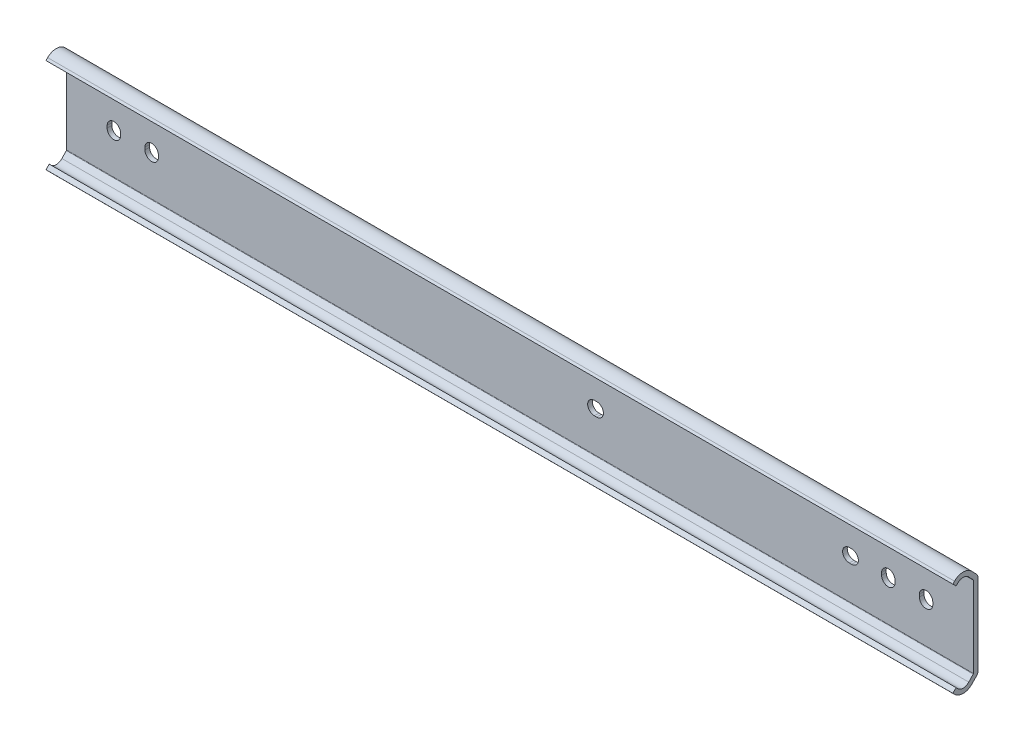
ISO-10303-21;
HEADER;
FILE_DESCRIPTION(('STEP AP214'),'2;1');
FILE_NAME('part.step','',(''),(''),'','','');
FILE_SCHEMA(('AUTOMOTIVE_DESIGN { 1 0 10303 214 1 1 1 1 }'));
ENDSEC;
DATA;
#1=APPLICATION_CONTEXT('core data for automotive mechanical design processes');
#2=APPLICATION_PROTOCOL_DEFINITION('international standard','automotive_design',2000,#1);
#3=PRODUCT_CONTEXT('',#1,'mechanical');
#4=PRODUCT('Part','Part','',(#3));
#5=PRODUCT_RELATED_PRODUCT_CATEGORY('part','',(#4));
#6=PRODUCT_DEFINITION_FORMATION('','',#4);
#7=PRODUCT_DEFINITION_CONTEXT('part definition',#1,'design');
#8=PRODUCT_DEFINITION('design','',#6,#7);
#9=PRODUCT_DEFINITION_SHAPE('','',#8);
#10=(LENGTH_UNIT() NAMED_UNIT(*) SI_UNIT(.MILLI.,.METRE.));
#11=(NAMED_UNIT(*) PLANE_ANGLE_UNIT() SI_UNIT($,.RADIAN.));
#12=(NAMED_UNIT(*) SI_UNIT($,.STERADIAN.) SOLID_ANGLE_UNIT());
#13=UNCERTAINTY_MEASURE_WITH_UNIT(LENGTH_MEASURE(1.E-05),#10,'distance_accuracy_value','');
#14=(GEOMETRIC_REPRESENTATION_CONTEXT(3) GLOBAL_UNCERTAINTY_ASSIGNED_CONTEXT((#13)) GLOBAL_UNIT_ASSIGNED_CONTEXT((#10,
#11,#12)) REPRESENTATION_CONTEXT('',''));
#15=CARTESIAN_POINT('',(0.,0.,0.));
#16=DIRECTION('',(0.,0.,1.));
#17=DIRECTION('',(1.,0.,0.));
#18=AXIS2_PLACEMENT_3D('',#15,#16,#17);
#19=CARTESIAN_POINT('',(-15.9,-13.5610180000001,0.));
#20=DIRECTION('',(0.,0.,-1.));
#21=DIRECTION('',(1.,0.,0.));
#22=AXIS2_PLACEMENT_3D('',#19,#20,#21);
#23=PLANE('',#22);
#24=DIRECTION('',(1.,0.,0.));
#25=VECTOR('',#24,1.);
#26=CARTESIAN_POINT('',(-15.9,13.561018,0.));
#27=LINE('',#26,#25);
#28=CARTESIAN_POINT('',(-15.9,13.561018,0.));
#29=VERTEX_POINT('',#28);
#30=CARTESIAN_POINT('',(288.9,13.561018,0.));
#31=VERTEX_POINT('',#30);
#32=EDGE_CURVE('E614',#29,#31,#27,.T.);
#33=ORIENTED_EDGE('',*,*,#32,.T.);
#34=DIRECTION('',(0.,1.,0.));
#35=VECTOR('',#34,1.);
#36=CARTESIAN_POINT('',(288.9,-13.5610180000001,0.));
#37=LINE('',#36,#35);
#38=CARTESIAN_POINT('',(288.9,-13.5610180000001,0.));
#39=VERTEX_POINT('',#38);
#40=EDGE_CURVE('E548',#39,#31,#37,.T.);
#41=ORIENTED_EDGE('',*,*,#40,.F.);
#42=DIRECTION('',(1.,0.,0.));
#43=VECTOR('',#42,1.);
#44=CARTESIAN_POINT('',(-15.9,-13.5610180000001,0.));
#45=LINE('',#44,#43);
#46=CARTESIAN_POINT('',(-15.9,-13.5610180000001,0.));
#47=VERTEX_POINT('',#46);
#48=EDGE_CURVE('E617',#47,#39,#45,.T.);
#49=ORIENTED_EDGE('',*,*,#48,.F.);
#50=DIRECTION('',(0.,1.,0.));
#51=VECTOR('',#50,1.);
#52=CARTESIAN_POINT('',(-15.9,-13.5610180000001,0.));
#53=LINE('',#52,#51);
#54=EDGE_CURVE('E605',#47,#29,#53,.T.);
#55=ORIENTED_EDGE('',*,*,#54,.T.);
#56=EDGE_LOOP('',(#33,#41,#49,#55));
#57=FACE_BOUND('',#56,.T.);
#58=CARTESIAN_POINT('',(162.3,0.,0.));
#59=DIRECTION('',(0.,0.,-1.));
#60=DIRECTION('',(1.,0.,0.));
#61=AXIS2_PLACEMENT_3D('',#58,#59,#60);
#62=CIRCLE('',#61,2.25);
#63=CARTESIAN_POINT('',(162.3,-2.25,0.));
#64=VERTEX_POINT('',#63);
#65=CARTESIAN_POINT('',(162.3,2.25,0.));
#66=VERTEX_POINT('',#65);
#67=EDGE_CURVE('E319',#64,#66,#62,.F.);
#68=ORIENTED_EDGE('',*,*,#67,.T.);
#69=DIRECTION('',(-1.,0.,0.));
#70=VECTOR('',#69,1.);
#71=CARTESIAN_POINT('',(162.3,2.25,0.));
#72=LINE('',#71,#70);
#73=CARTESIAN_POINT('',(161.5,2.25,0.));
#74=VERTEX_POINT('',#73);
#75=EDGE_CURVE('E331',#66,#74,#72,.T.);
#76=ORIENTED_EDGE('',*,*,#75,.T.);
#77=CARTESIAN_POINT('',(161.5,0.,0.));
#78=DIRECTION('',(0.,0.,-1.));
#79=DIRECTION('',(1.,0.,0.));
#80=AXIS2_PLACEMENT_3D('',#77,#78,#79);
#81=CIRCLE('',#80,2.25);
#82=CARTESIAN_POINT('',(161.5,-2.25,0.));
#83=VERTEX_POINT('',#82);
#84=EDGE_CURVE('E320',#74,#83,#81,.F.);
#85=ORIENTED_EDGE('',*,*,#84,.T.);
#86=DIRECTION('',(1.,0.,0.));
#87=VECTOR('',#86,1.);
#88=CARTESIAN_POINT('',(161.5,-2.25,0.));
#89=LINE('',#88,#87);
#90=EDGE_CURVE('E340',#83,#64,#89,.T.);
#91=ORIENTED_EDGE('',*,*,#90,.T.);
#92=EDGE_LOOP('',(#68,#76,#85,#91));
#93=FACE_BOUND('',#92,.T.);
#94=CARTESIAN_POINT('',(260.3,0.400000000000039,0.));
#95=DIRECTION('',(0.,0.,1.));
#96=DIRECTION('',(1.,0.,0.));
#97=AXIS2_PLACEMENT_3D('',#94,#95,#96);
#98=CIRCLE('',#97,2.24999999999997);
#99=CARTESIAN_POINT('',(262.55,0.400000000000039,0.));
#100=VERTEX_POINT('',#99);
#101=CARTESIAN_POINT('',(258.05,0.400000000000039,0.));
#102=VERTEX_POINT('',#101);
#103=EDGE_CURVE('E478',#100,#102,#98,.T.);
#104=ORIENTED_EDGE('',*,*,#103,.T.);
#105=DIRECTION('',(0.,-1.,0.));
#106=VECTOR('',#105,1.);
#107=CARTESIAN_POINT('',(258.05,0.400000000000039,0.));
#108=LINE('',#107,#106);
#109=CARTESIAN_POINT('',(258.05,-0.400000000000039,0.));
#110=VERTEX_POINT('',#109);
#111=EDGE_CURVE('E481',#102,#110,#108,.T.);
#112=ORIENTED_EDGE('',*,*,#111,.T.);
#113=CARTESIAN_POINT('',(260.3,-0.400000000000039,0.));
#114=DIRECTION('',(0.,0.,1.));
#115=DIRECTION('',(1.,0.,0.));
#116=AXIS2_PLACEMENT_3D('',#113,#114,#115);
#117=CIRCLE('',#116,2.24999999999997);
#118=CARTESIAN_POINT('',(262.55,-0.400000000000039,0.));
#119=VERTEX_POINT('',#118);
#120=EDGE_CURVE('E484',#110,#119,#117,.T.);
#121=ORIENTED_EDGE('',*,*,#120,.T.);
#122=DIRECTION('',(0.,1.,0.));
#123=VECTOR('',#122,1.);
#124=CARTESIAN_POINT('',(262.55,0.400000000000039,0.));
#125=LINE('',#124,#123);
#126=EDGE_CURVE('E487',#119,#100,#125,.T.);
#127=ORIENTED_EDGE('',*,*,#126,.T.);
#128=EDGE_LOOP('',(#104,#112,#121,#127));
#129=FACE_BOUND('',#128,.T.);
#130=CARTESIAN_POINT('',(273.,0.400000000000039,0.));
#131=DIRECTION('',(0.,0.,1.));
#132=DIRECTION('',(1.,0.,0.));
#133=AXIS2_PLACEMENT_3D('',#130,#131,#132);
#134=CIRCLE('',#133,2.24999999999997);
#135=CARTESIAN_POINT('',(275.25,0.400000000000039,0.));
#136=VERTEX_POINT('',#135);
#137=CARTESIAN_POINT('',(270.75,0.400000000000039,0.));
#138=VERTEX_POINT('',#137);
#139=EDGE_CURVE('E446',#136,#138,#134,.T.);
#140=ORIENTED_EDGE('',*,*,#139,.T.);
#141=DIRECTION('',(0.,-1.,0.));
#142=VECTOR('',#141,1.);
#143=CARTESIAN_POINT('',(270.75,0.400000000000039,0.));
#144=LINE('',#143,#142);
#145=CARTESIAN_POINT('',(270.75,-0.400000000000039,0.));
#146=VERTEX_POINT('',#145);
#147=EDGE_CURVE('E449',#138,#146,#144,.T.);
#148=ORIENTED_EDGE('',*,*,#147,.T.);
#149=CARTESIAN_POINT('',(273.,-0.400000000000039,0.));
#150=DIRECTION('',(0.,0.,1.));
#151=DIRECTION('',(1.,0.,0.));
#152=AXIS2_PLACEMENT_3D('',#149,#150,#151);
#153=CIRCLE('',#152,2.24999999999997);
#154=CARTESIAN_POINT('',(275.25,-0.400000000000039,0.));
#155=VERTEX_POINT('',#154);
#156=EDGE_CURVE('E452',#146,#155,#153,.T.);
#157=ORIENTED_EDGE('',*,*,#156,.T.);
#158=DIRECTION('',(0.,1.,0.));
#159=VECTOR('',#158,1.);
#160=CARTESIAN_POINT('',(275.25,0.400000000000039,0.));
#161=LINE('',#160,#159);
#162=EDGE_CURVE('E455',#155,#136,#161,.T.);
#163=ORIENTED_EDGE('',*,*,#162,.T.);
#164=EDGE_LOOP('',(#140,#148,#157,#163));
#165=FACE_BOUND('',#164,.T.);
#166=CARTESIAN_POINT('',(0.,0.400000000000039,0.));
#167=DIRECTION('',(0.,0.,1.));
#168=DIRECTION('',(1.,0.,0.));
#169=AXIS2_PLACEMENT_3D('',#166,#167,#168);
#170=CIRCLE('',#169,2.24999999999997);
#171=CARTESIAN_POINT('',(2.24999999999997,0.400000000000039,0.));
#172=VERTEX_POINT('',#171);
#173=CARTESIAN_POINT('',(-2.25000000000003,0.400000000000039,0.));
#174=VERTEX_POINT('',#173);
#175=EDGE_CURVE('E414',#172,#174,#170,.T.);
#176=ORIENTED_EDGE('',*,*,#175,.T.);
#177=DIRECTION('',(0.,-1.,0.));
#178=VECTOR('',#177,1.);
#179=CARTESIAN_POINT('',(-2.25000000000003,0.400000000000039,0.));
#180=LINE('',#179,#178);
#181=CARTESIAN_POINT('',(-2.25000000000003,-0.400000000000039,0.));
#182=VERTEX_POINT('',#181);
#183=EDGE_CURVE('E417',#174,#182,#180,.T.);
#184=ORIENTED_EDGE('',*,*,#183,.T.);
#185=CARTESIAN_POINT('',(0.,-0.400000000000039,0.));
#186=DIRECTION('',(0.,0.,1.));
#187=DIRECTION('',(1.,0.,0.));
#188=AXIS2_PLACEMENT_3D('',#185,#186,#187);
#189=CIRCLE('',#188,2.24999999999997);
#190=CARTESIAN_POINT('',(2.24999999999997,-0.400000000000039,0.));
#191=VERTEX_POINT('',#190);
#192=EDGE_CURVE('E420',#182,#191,#189,.T.);
#193=ORIENTED_EDGE('',*,*,#192,.T.);
#194=DIRECTION('',(0.,1.,0.));
#195=VECTOR('',#194,1.);
#196=CARTESIAN_POINT('',(2.24999999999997,0.400000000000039,0.));
#197=LINE('',#196,#195);
#198=EDGE_CURVE('E423',#191,#172,#197,.T.);
#199=ORIENTED_EDGE('',*,*,#198,.T.);
#200=EDGE_LOOP('',(#176,#184,#193,#199));
#201=FACE_BOUND('',#200,.T.);
#202=CARTESIAN_POINT('',(248.,0.,0.));
#203=DIRECTION('',(0.,0.,1.));
#204=DIRECTION('',(1.,0.,0.));
#205=AXIS2_PLACEMENT_3D('',#202,#203,#204);
#206=CIRCLE('',#205,2.25);
#207=CARTESIAN_POINT('',(248.,-2.25,0.));
#208=VERTEX_POINT('',#207);
#209=CARTESIAN_POINT('',(248.,2.25,0.));
#210=VERTEX_POINT('',#209);
#211=EDGE_CURVE('E382',#208,#210,#206,.T.);
#212=ORIENTED_EDGE('',*,*,#211,.T.);
#213=DIRECTION('',(-1.,0.,0.));
#214=VECTOR('',#213,1.);
#215=CARTESIAN_POINT('',(248.,2.25,0.));
#216=LINE('',#215,#214);
#217=CARTESIAN_POINT('',(247.2,2.25,0.));
#218=VERTEX_POINT('',#217);
#219=EDGE_CURVE('E385',#210,#218,#216,.T.);
#220=ORIENTED_EDGE('',*,*,#219,.T.);
#221=CARTESIAN_POINT('',(247.2,0.,0.));
#222=DIRECTION('',(0.,0.,1.));
#223=DIRECTION('',(1.,0.,0.));
#224=AXIS2_PLACEMENT_3D('',#221,#222,#223);
#225=CIRCLE('',#224,2.25);
#226=CARTESIAN_POINT('',(247.2,-2.25,0.));
#227=VERTEX_POINT('',#226);
#228=EDGE_CURVE('E388',#218,#227,#225,.T.);
#229=ORIENTED_EDGE('',*,*,#228,.T.);
#230=DIRECTION('',(1.,0.,0.));
#231=VECTOR('',#230,1.);
#232=CARTESIAN_POINT('',(248.,-2.25,0.));
#233=LINE('',#232,#231);
#234=EDGE_CURVE('E391',#227,#208,#233,.T.);
#235=ORIENTED_EDGE('',*,*,#234,.T.);
#236=EDGE_LOOP('',(#212,#220,#229,#235));
#237=FACE_BOUND('',#236,.T.);
#238=CARTESIAN_POINT('',(12.7,0.400000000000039,0.));
#239=DIRECTION('',(0.,0.,1.));
#240=DIRECTION('',(1.,0.,0.));
#241=AXIS2_PLACEMENT_3D('',#238,#239,#240);
#242=CIRCLE('',#241,2.24999999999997);
#243=CARTESIAN_POINT('',(14.95,0.400000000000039,0.));
#244=VERTEX_POINT('',#243);
#245=CARTESIAN_POINT('',(10.45,0.400000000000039,0.));
#246=VERTEX_POINT('',#245);
#247=EDGE_CURVE('E353',#244,#246,#242,.T.);
#248=ORIENTED_EDGE('',*,*,#247,.T.);
#249=DIRECTION('',(0.,-1.,0.));
#250=VECTOR('',#249,1.);
#251=CARTESIAN_POINT('',(10.45,0.400000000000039,0.));
#252=LINE('',#251,#250);
#253=CARTESIAN_POINT('',(10.45,-0.400000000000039,0.));
#254=VERTEX_POINT('',#253);
#255=EDGE_CURVE('E356',#246,#254,#252,.T.);
#256=ORIENTED_EDGE('',*,*,#255,.T.);
#257=CARTESIAN_POINT('',(12.7,-0.400000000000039,0.));
#258=DIRECTION('',(0.,0.,1.));
#259=DIRECTION('',(1.,0.,0.));
#260=AXIS2_PLACEMENT_3D('',#257,#258,#259);
#261=CIRCLE('',#260,2.24999999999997);
#262=CARTESIAN_POINT('',(14.95,-0.400000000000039,0.));
#263=VERTEX_POINT('',#262);
#264=EDGE_CURVE('E33',#254,#263,#261,.T.);
#265=ORIENTED_EDGE('',*,*,#264,.T.);
#266=DIRECTION('',(0.,1.,0.));
#267=VECTOR('',#266,1.);
#268=CARTESIAN_POINT('',(14.95,0.400000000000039,0.));
#269=LINE('',#268,#267);
#270=EDGE_CURVE('E360',#263,#244,#269,.T.);
#271=ORIENTED_EDGE('',*,*,#270,.T.);
#272=EDGE_LOOP('',(#248,#256,#265,#271));
#273=FACE_BOUND('',#272,.T.);
#274=ADVANCED_FACE('F16',(#57,#93,#129,#165,#201,#237,#273),#23,.T.);
#275=CARTESIAN_POINT('',(-15.9,13.561018,1.54999999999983));
#276=DIRECTION('',(0.,0.,1.));
#277=DIRECTION('',(-1.,0.,0.));
#278=AXIS2_PLACEMENT_3D('',#275,#276,#277);
#279=PLANE('',#278);
#280=DIRECTION('',(1.,0.,0.));
#281=VECTOR('',#280,1.);
#282=CARTESIAN_POINT('',(-15.9,-13.5610180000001,1.54999999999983));
#283=LINE('',#282,#281);
#284=CARTESIAN_POINT('',(-15.9,-13.5610180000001,1.54999999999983));
#285=VERTEX_POINT('',#284);
#286=CARTESIAN_POINT('',(288.9,-13.5610180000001,1.54999999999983));
#287=VERTEX_POINT('',#286);
#288=EDGE_CURVE('E636',#285,#287,#283,.T.);
#289=ORIENTED_EDGE('',*,*,#288,.T.);
#290=DIRECTION('',(0.,-1.,0.));
#291=VECTOR('',#290,1.);
#292=CARTESIAN_POINT('',(288.9,13.561018,1.54999999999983));
#293=LINE('',#292,#291);
#294=CARTESIAN_POINT('',(288.9,13.561018,1.54999999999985));
#295=VERTEX_POINT('',#294);
#296=EDGE_CURVE('E520',#295,#287,#293,.T.);
#297=ORIENTED_EDGE('',*,*,#296,.F.);
#298=DIRECTION('',(1.,0.,0.));
#299=VECTOR('',#298,1.);
#300=CARTESIAN_POINT('',(-15.9,13.561018,1.54999999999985));
#301=LINE('',#300,#299);
#302=CARTESIAN_POINT('',(-15.9,13.561018,1.54999999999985));
#303=VERTEX_POINT('',#302);
#304=EDGE_CURVE('E639',#303,#295,#301,.T.);
#305=ORIENTED_EDGE('',*,*,#304,.F.);
#306=DIRECTION('',(0.,-1.,0.));
#307=VECTOR('',#306,1.);
#308=CARTESIAN_POINT('',(-15.9,13.561018,1.54999999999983));
#309=LINE('',#308,#307);
#310=EDGE_CURVE('E576',#303,#285,#309,.T.);
#311=ORIENTED_EDGE('',*,*,#310,.T.);
#312=EDGE_LOOP('',(#289,#297,#305,#311));
#313=FACE_BOUND('',#312,.T.);
#314=DIRECTION('',(-1.,0.,0.));
#315=VECTOR('',#314,1.);
#316=CARTESIAN_POINT('',(162.3,2.25,1.54999999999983));
#317=LINE('',#316,#315);
#318=CARTESIAN_POINT('',(162.3,2.25,1.54999999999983));
#319=VERTEX_POINT('',#318);
#320=CARTESIAN_POINT('',(161.5,2.25,1.54999999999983));
#321=VERTEX_POINT('',#320);
#322=EDGE_CURVE('E310',#319,#321,#317,.T.);
#323=ORIENTED_EDGE('',*,*,#322,.F.);
#324=CARTESIAN_POINT('',(162.3,0.,1.54999999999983));
#325=DIRECTION('',(0.,0.,1.));
#326=DIRECTION('',(-1.,0.,0.));
#327=AXIS2_PLACEMENT_3D('',#324,#325,#326);
#328=CIRCLE('',#327,2.25);
#329=CARTESIAN_POINT('',(162.3,-2.25,1.54999999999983));
#330=VERTEX_POINT('',#329);
#331=EDGE_CURVE('E317',#330,#319,#328,.T.);
#332=ORIENTED_EDGE('',*,*,#331,.F.);
#333=DIRECTION('',(1.,0.,0.));
#334=VECTOR('',#333,1.);
#335=CARTESIAN_POINT('',(161.5,-2.25,1.54999999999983));
#336=LINE('',#335,#334);
#337=CARTESIAN_POINT('',(161.5,-2.25,1.54999999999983));
#338=VERTEX_POINT('',#337);
#339=EDGE_CURVE('E299',#338,#330,#336,.T.);
#340=ORIENTED_EDGE('',*,*,#339,.F.);
#341=CARTESIAN_POINT('',(161.5,0.,1.54999999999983));
#342=DIRECTION('',(0.,0.,1.));
#343=DIRECTION('',(-1.,0.,0.));
#344=AXIS2_PLACEMENT_3D('',#341,#342,#343);
#345=CIRCLE('',#344,2.25);
#346=EDGE_CURVE('E311',#321,#338,#345,.T.);
#347=ORIENTED_EDGE('',*,*,#346,.F.);
#348=EDGE_LOOP('',(#323,#332,#340,#347));
#349=FACE_BOUND('',#348,.T.);
#350=CARTESIAN_POINT('',(260.3,0.400000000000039,1.54999999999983));
#351=DIRECTION('',(0.,0.,1.));
#352=DIRECTION('',(1.,0.,0.));
#353=AXIS2_PLACEMENT_3D('',#350,#351,#352);
#354=CIRCLE('',#353,2.24999999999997);
#355=CARTESIAN_POINT('',(262.55,0.400000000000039,1.54999999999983));
#356=VERTEX_POINT('',#355);
#357=CARTESIAN_POINT('',(258.05,0.400000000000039,1.54999999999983));
#358=VERTEX_POINT('',#357);
#359=EDGE_CURVE('E461',#356,#358,#354,.T.);
#360=ORIENTED_EDGE('',*,*,#359,.F.);
#361=DIRECTION('',(0.,1.,0.));
#362=VECTOR('',#361,1.);
#363=CARTESIAN_POINT('',(262.55,0.400000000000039,1.54999999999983));
#364=LINE('',#363,#362);
#365=CARTESIAN_POINT('',(262.55,-0.400000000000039,1.54999999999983));
#366=VERTEX_POINT('',#365);
#367=EDGE_CURVE('E475',#366,#356,#364,.T.);
#368=ORIENTED_EDGE('',*,*,#367,.F.);
#369=CARTESIAN_POINT('',(260.3,-0.400000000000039,1.54999999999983));
#370=DIRECTION('',(0.,0.,1.));
#371=DIRECTION('',(1.,0.,0.));
#372=AXIS2_PLACEMENT_3D('',#369,#370,#371);
#373=CIRCLE('',#372,2.24999999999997);
#374=CARTESIAN_POINT('',(258.05,-0.40000000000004,1.54999999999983));
#375=VERTEX_POINT('',#374);
#376=EDGE_CURVE('E472',#375,#366,#373,.T.);
#377=ORIENTED_EDGE('',*,*,#376,.F.);
#378=DIRECTION('',(0.,-1.,0.));
#379=VECTOR('',#378,1.);
#380=CARTESIAN_POINT('',(258.05,0.400000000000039,1.54999999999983));
#381=LINE('',#380,#379);
#382=EDGE_CURVE('E469',#358,#375,#381,.T.);
#383=ORIENTED_EDGE('',*,*,#382,.F.);
#384=EDGE_LOOP('',(#360,#368,#377,#383));
#385=FACE_BOUND('',#384,.T.);
#386=CARTESIAN_POINT('',(273.,0.400000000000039,1.54999999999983));
#387=DIRECTION('',(0.,0.,1.));
#388=DIRECTION('',(1.,0.,0.));
#389=AXIS2_PLACEMENT_3D('',#386,#387,#388);
#390=CIRCLE('',#389,2.24999999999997);
#391=CARTESIAN_POINT('',(275.25,0.400000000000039,1.54999999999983));
#392=VERTEX_POINT('',#391);
#393=CARTESIAN_POINT('',(270.75,0.400000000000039,1.54999999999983));
#394=VERTEX_POINT('',#393);
#395=EDGE_CURVE('E429',#392,#394,#390,.T.);
#396=ORIENTED_EDGE('',*,*,#395,.F.);
#397=DIRECTION('',(0.,1.,0.));
#398=VECTOR('',#397,1.);
#399=CARTESIAN_POINT('',(275.25,0.400000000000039,1.54999999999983));
#400=LINE('',#399,#398);
#401=CARTESIAN_POINT('',(275.25,-0.400000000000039,1.54999999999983));
#402=VERTEX_POINT('',#401);
#403=EDGE_CURVE('E443',#402,#392,#400,.T.);
#404=ORIENTED_EDGE('',*,*,#403,.F.);
#405=CARTESIAN_POINT('',(273.,-0.400000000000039,1.54999999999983));
#406=DIRECTION('',(0.,0.,1.));
#407=DIRECTION('',(1.,0.,0.));
#408=AXIS2_PLACEMENT_3D('',#405,#406,#407);
#409=CIRCLE('',#408,2.24999999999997);
#410=CARTESIAN_POINT('',(270.75,-0.40000000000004,1.54999999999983));
#411=VERTEX_POINT('',#410);
#412=EDGE_CURVE('E440',#411,#402,#409,.T.);
#413=ORIENTED_EDGE('',*,*,#412,.F.);
#414=DIRECTION('',(0.,-1.,0.));
#415=VECTOR('',#414,1.);
#416=CARTESIAN_POINT('',(270.75,0.400000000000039,1.54999999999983));
#417=LINE('',#416,#415);
#418=EDGE_CURVE('E437',#394,#411,#417,.T.);
#419=ORIENTED_EDGE('',*,*,#418,.F.);
#420=EDGE_LOOP('',(#396,#404,#413,#419));
#421=FACE_BOUND('',#420,.T.);
#422=CARTESIAN_POINT('',(0.,0.400000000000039,1.54999999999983));
#423=DIRECTION('',(0.,0.,1.));
#424=DIRECTION('',(1.,0.,0.));
#425=AXIS2_PLACEMENT_3D('',#422,#423,#424);
#426=CIRCLE('',#425,2.24999999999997);
#427=CARTESIAN_POINT('',(2.24999999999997,0.400000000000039,1.54999999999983));
#428=VERTEX_POINT('',#427);
#429=CARTESIAN_POINT('',(-2.25000000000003,0.400000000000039,1.54999999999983));
#430=VERTEX_POINT('',#429);
#431=EDGE_CURVE('E397',#428,#430,#426,.T.);
#432=ORIENTED_EDGE('',*,*,#431,.F.);
#433=DIRECTION('',(0.,1.,0.));
#434=VECTOR('',#433,1.);
#435=CARTESIAN_POINT('',(2.24999999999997,0.400000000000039,1.54999999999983));
#436=LINE('',#435,#434);
#437=CARTESIAN_POINT('',(2.24999999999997,-0.400000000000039,1.54999999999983));
#438=VERTEX_POINT('',#437);
#439=EDGE_CURVE('E411',#438,#428,#436,.T.);
#440=ORIENTED_EDGE('',*,*,#439,.F.);
#441=CARTESIAN_POINT('',(0.,-0.400000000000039,1.54999999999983));
#442=DIRECTION('',(0.,0.,1.));
#443=DIRECTION('',(1.,0.,0.));
#444=AXIS2_PLACEMENT_3D('',#441,#442,#443);
#445=CIRCLE('',#444,2.24999999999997);
#446=CARTESIAN_POINT('',(-2.25000000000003,-0.40000000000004,1.54999999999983));
#447=VERTEX_POINT('',#446);
#448=EDGE_CURVE('E408',#447,#438,#445,.T.);
#449=ORIENTED_EDGE('',*,*,#448,.F.);
#450=DIRECTION('',(0.,-1.,0.));
#451=VECTOR('',#450,1.);
#452=CARTESIAN_POINT('',(-2.25000000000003,0.400000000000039,1.54999999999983));
#453=LINE('',#452,#451);
#454=EDGE_CURVE('E405',#430,#447,#453,.T.);
#455=ORIENTED_EDGE('',*,*,#454,.F.);
#456=EDGE_LOOP('',(#432,#440,#449,#455));
#457=FACE_BOUND('',#456,.T.);
#458=CARTESIAN_POINT('',(248.,0.,1.54999999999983));
#459=DIRECTION('',(0.,0.,1.));
#460=DIRECTION('',(1.,0.,0.));
#461=AXIS2_PLACEMENT_3D('',#458,#459,#460);
#462=CIRCLE('',#461,2.25);
#463=CARTESIAN_POINT('',(248.,-2.25,1.54999999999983));
#464=VERTEX_POINT('',#463);
#465=CARTESIAN_POINT('',(248.,2.25,1.54999999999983));
#466=VERTEX_POINT('',#465);
#467=EDGE_CURVE('E366',#464,#466,#462,.T.);
#468=ORIENTED_EDGE('',*,*,#467,.F.);
#469=DIRECTION('',(1.,0.,0.));
#470=VECTOR('',#469,1.);
#471=CARTESIAN_POINT('',(248.,-2.25,1.54999999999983));
#472=LINE('',#471,#470);
#473=CARTESIAN_POINT('',(247.2,-2.25,1.54999999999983));
#474=VERTEX_POINT('',#473);
#475=EDGE_CURVE('E379',#474,#464,#472,.T.);
#476=ORIENTED_EDGE('',*,*,#475,.F.);
#477=CARTESIAN_POINT('',(247.2,0.,1.54999999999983));
#478=DIRECTION('',(0.,0.,1.));
#479=DIRECTION('',(1.,0.,0.));
#480=AXIS2_PLACEMENT_3D('',#477,#478,#479);
#481=CIRCLE('',#480,2.25);
#482=CARTESIAN_POINT('',(247.2,2.25,1.54999999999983));
#483=VERTEX_POINT('',#482);
#484=EDGE_CURVE('E376',#483,#474,#481,.T.);
#485=ORIENTED_EDGE('',*,*,#484,.F.);
#486=DIRECTION('',(-1.,0.,0.));
#487=VECTOR('',#486,1.);
#488=CARTESIAN_POINT('',(248.,2.25,1.54999999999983));
#489=LINE('',#488,#487);
#490=EDGE_CURVE('E373',#466,#483,#489,.T.);
#491=ORIENTED_EDGE('',*,*,#490,.F.);
#492=EDGE_LOOP('',(#468,#476,#485,#491));
#493=FACE_BOUND('',#492,.T.);
#494=CARTESIAN_POINT('',(12.7,0.400000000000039,1.54999999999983));
#495=DIRECTION('',(0.,0.,1.));
#496=DIRECTION('',(1.,0.,0.));
#497=AXIS2_PLACEMENT_3D('',#494,#495,#496);
#498=CIRCLE('',#497,2.24999999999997);
#499=CARTESIAN_POINT('',(14.95,0.400000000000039,1.54999999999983));
#500=VERTEX_POINT('',#499);
#501=CARTESIAN_POINT('',(10.45,0.400000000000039,1.54999999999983));
#502=VERTEX_POINT('',#501);
#503=EDGE_CURVE('E41',#500,#502,#498,.T.);
#504=ORIENTED_EDGE('',*,*,#503,.F.);
#505=DIRECTION('',(0.,1.,0.));
#506=VECTOR('',#505,1.);
#507=CARTESIAN_POINT('',(14.95,0.400000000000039,1.54999999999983));
#508=LINE('',#507,#506);
#509=CARTESIAN_POINT('',(14.95,-0.400000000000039,1.54999999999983));
#510=VERTEX_POINT('',#509);
#511=EDGE_CURVE('E350',#510,#500,#508,.T.);
#512=ORIENTED_EDGE('',*,*,#511,.F.);
#513=CARTESIAN_POINT('',(12.7,-0.400000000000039,1.54999999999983));
#514=DIRECTION('',(0.,0.,1.));
#515=DIRECTION('',(1.,0.,0.));
#516=AXIS2_PLACEMENT_3D('',#513,#514,#515);
#517=CIRCLE('',#516,2.24999999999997);
#518=CARTESIAN_POINT('',(10.45,-0.40000000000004,1.54999999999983));
#519=VERTEX_POINT('',#518);
#520=EDGE_CURVE('E347',#519,#510,#517,.T.);
#521=ORIENTED_EDGE('',*,*,#520,.F.);
#522=DIRECTION('',(0.,-1.,0.));
#523=VECTOR('',#522,1.);
#524=CARTESIAN_POINT('',(10.45,0.400000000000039,1.54999999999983));
#525=LINE('',#524,#523);
#526=EDGE_CURVE('E344',#502,#519,#525,.T.);
#527=ORIENTED_EDGE('',*,*,#526,.F.);
#528=EDGE_LOOP('',(#504,#512,#521,#527));
#529=FACE_BOUND('',#528,.T.);
#530=ADVANCED_FACE('F323',(#313,#349,#385,#421,#457,#493,#529),#279,.T.);
#531=CARTESIAN_POINT('',(288.9,13.575,5.00000000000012));
#532=DIRECTION('',(-1.,0.,0.));
#533=DIRECTION('',(0.,0.,-1.));
#534=AXIS2_PLACEMENT_3D('',#531,#532,#533);
#535=PLANE('',#534);
#536=ORIENTED_EDGE('',*,*,#40,.T.);
#537=CARTESIAN_POINT('',(288.9,13.5610179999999,1.80000000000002));
#538=DIRECTION('',(1.,0.,0.));
#539=DIRECTION('',(0.,0.,-1.));
#540=AXIS2_PLACEMENT_3D('',#537,#538,#539);
#541=CIRCLE('',#540,1.8);
#542=CARTESIAN_POINT('',(288.9,14.8073560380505,0.501292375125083));
#543=VERTEX_POINT('',#542);
#544=EDGE_CURVE('E550',#31,#543,#541,.T.);
#545=ORIENTED_EDGE('',*,*,#544,.T.);
#546=DIRECTION('',(0.,0.721504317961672,0.692409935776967));
#547=VECTOR('',#546,1.);
#548=CARTESIAN_POINT('',(288.9,14.8073560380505,0.501292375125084));
#549=LINE('',#548,#547);
#550=CARTESIAN_POINT('',(288.9,16.4741282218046,2.10085261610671));
#551=VERTEX_POINT('',#550);
#552=EDGE_CURVE('E553',#543,#551,#549,.T.);
#553=ORIENTED_EDGE('',*,*,#552,.T.);
#554=CARTESIAN_POINT('',(288.9,13.575,5.00000000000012));
#555=DIRECTION('',(1.,0.,0.));
#556=DIRECTION('',(0.,0.,-1.));
#557=AXIS2_PLACEMENT_3D('',#554,#555,#556);
#558=CIRCLE('',#557,4.1);
#559=CARTESIAN_POINT('',(288.9,16.4741282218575,7.89914738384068));
#560=VERTEX_POINT('',#559);
#561=EDGE_CURVE('E493',#551,#560,#558,.T.);
#562=ORIENTED_EDGE('',*,*,#561,.T.);
#563=DIRECTION('',(0.,-0.721504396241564,0.692409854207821));
#564=VECTOR('',#563,1.);
#565=CARTESIAN_POINT('',(288.9,15.8897090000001,8.45999999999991));
#566=LINE('',#565,#564);
#567=CARTESIAN_POINT('',(288.9,15.8897090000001,8.45999999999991));
#568=VERTEX_POINT('',#567);
#569=EDGE_CURVE('E502',#560,#568,#566,.T.);
#570=ORIENTED_EDGE('',*,*,#569,.T.);
#571=DIRECTION('',(0.,-0.707106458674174,-0.707107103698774));
#572=VECTOR('',#571,1.);
#573=CARTESIAN_POINT('',(288.9,14.793462,7.363752));
#574=LINE('',#573,#572);
#575=CARTESIAN_POINT('',(288.9,14.793462,7.363752));
#576=VERTEX_POINT('',#575);
#577=EDGE_CURVE('E505',#568,#576,#574,.T.);
#578=ORIENTED_EDGE('',*,*,#577,.T.);
#579=DIRECTION('',(0.,0.721503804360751,-0.692410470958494));
#580=VECTOR('',#579,1.);
#581=CARTESIAN_POINT('',(288.9,15.3880487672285,6.79314086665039));
#582=LINE('',#581,#580);
#583=CARTESIAN_POINT('',(288.9,15.3880487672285,6.79314086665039));
#584=VERTEX_POINT('',#583);
#585=EDGE_CURVE('E508',#576,#584,#582,.T.);
#586=ORIENTED_EDGE('',*,*,#585,.T.);
#587=CARTESIAN_POINT('',(288.9,13.575,5.00000000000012));
#588=DIRECTION('',(-1.,0.,0.));
#589=DIRECTION('',(0.,0.,1.));
#590=AXIS2_PLACEMENT_3D('',#587,#588,#589);
#591=CIRCLE('',#590,2.55);
#592=CARTESIAN_POINT('',(288.9,15.2920682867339,3.11474762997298));
#593=VERTEX_POINT('',#592);
#594=EDGE_CURVE('E511',#584,#593,#591,.T.);
#595=ORIENTED_EDGE('',*,*,#594,.T.);
#596=DIRECTION('',(0.,-0.721504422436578,-0.692409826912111));
#597=VECTOR('',#596,1.);
#598=CARTESIAN_POINT('',(288.9,13.7341205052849,1.61962394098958));
#599=LINE('',#598,#597);
#600=CARTESIAN_POINT('',(288.9,13.7341205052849,1.61962394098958));
#601=VERTEX_POINT('',#600);
#602=EDGE_CURVE('E514',#593,#601,#599,.T.);
#603=ORIENTED_EDGE('',*,*,#602,.T.);
#604=CARTESIAN_POINT('',(288.9,13.5610179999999,1.80000000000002));
#605=DIRECTION('',(-1.,0.,0.));
#606=DIRECTION('',(0.,0.,1.));
#607=AXIS2_PLACEMENT_3D('',#604,#605,#606);
#608=CIRCLE('',#607,0.250000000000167);
#609=EDGE_CURVE('E517',#601,#295,#608,.T.);
#610=ORIENTED_EDGE('',*,*,#609,.T.);
#611=ORIENTED_EDGE('',*,*,#296,.T.);
#612=CARTESIAN_POINT('',(288.9,-13.561018,1.80000000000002));
#613=DIRECTION('',(-1.,0.,0.));
#614=DIRECTION('',(0.,0.,-1.));
#615=AXIS2_PLACEMENT_3D('',#612,#613,#614);
#616=CIRCLE('',#615,0.250000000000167);
#617=CARTESIAN_POINT('',(288.9,-13.734120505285,1.61962394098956));
#618=VERTEX_POINT('',#617);
#619=EDGE_CURVE('E522',#287,#618,#616,.T.);
#620=ORIENTED_EDGE('',*,*,#619,.T.);
#621=DIRECTION('',(0.,-0.721504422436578,0.692409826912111));
#622=VECTOR('',#621,1.);
#623=CARTESIAN_POINT('',(288.9,-13.734120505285,1.61962394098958));
#624=LINE('',#623,#622);
#625=CARTESIAN_POINT('',(288.9,-15.292068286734,3.11474762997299));
#626=VERTEX_POINT('',#625);
#627=EDGE_CURVE('E525',#618,#626,#624,.T.);
#628=ORIENTED_EDGE('',*,*,#627,.T.);
#629=CARTESIAN_POINT('',(288.9,-13.5750000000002,5.00000000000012));
#630=DIRECTION('',(-1.,0.,0.));
#631=DIRECTION('',(0.,0.,-1.));
#632=AXIS2_PLACEMENT_3D('',#629,#630,#631);
#633=CIRCLE('',#632,2.55);
#634=CARTESIAN_POINT('',(288.9,-15.3880487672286,6.79314086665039));
#635=VERTEX_POINT('',#634);
#636=EDGE_CURVE('E528',#626,#635,#633,.T.);
#637=ORIENTED_EDGE('',*,*,#636,.T.);
#638=DIRECTION('',(0.,0.721503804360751,0.692410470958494));
#639=VECTOR('',#638,1.);
#640=CARTESIAN_POINT('',(288.9,-15.3880487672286,6.79314086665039));
#641=LINE('',#640,#639);
#642=CARTESIAN_POINT('',(288.9,-14.7934620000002,7.363752));
#643=VERTEX_POINT('',#642);
#644=EDGE_CURVE('E531',#635,#643,#641,.T.);
#645=ORIENTED_EDGE('',*,*,#644,.T.);
#646=DIRECTION('',(0.,-0.707106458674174,0.707107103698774));
#647=VECTOR('',#646,1.);
#648=CARTESIAN_POINT('',(288.9,-14.7934620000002,7.363752));
#649=LINE('',#648,#647);
#650=CARTESIAN_POINT('',(288.9,-15.8897090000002,8.45999999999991));
#651=VERTEX_POINT('',#650);
#652=EDGE_CURVE('E534',#643,#651,#649,.T.);
#653=ORIENTED_EDGE('',*,*,#652,.T.);
#654=DIRECTION('',(0.,-0.721504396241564,-0.692409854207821));
#655=VECTOR('',#654,1.);
#656=CARTESIAN_POINT('',(288.9,-15.8897090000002,8.45999999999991));
#657=LINE('',#656,#655);
#658=CARTESIAN_POINT('',(288.9,-16.4741282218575,7.89914738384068));
#659=VERTEX_POINT('',#658);
#660=EDGE_CURVE('E537',#651,#659,#657,.T.);
#661=ORIENTED_EDGE('',*,*,#660,.T.);
#662=CARTESIAN_POINT('',(288.9,-13.5750000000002,5.00000000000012));
#663=DIRECTION('',(1.,0.,0.));
#664=DIRECTION('',(0.,0.,1.));
#665=AXIS2_PLACEMENT_3D('',#662,#663,#664);
#666=CIRCLE('',#665,4.1);
#667=CARTESIAN_POINT('',(288.9,-16.4741282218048,2.10085261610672));
#668=VERTEX_POINT('',#667);
#669=EDGE_CURVE('E540',#659,#668,#666,.T.);
#670=ORIENTED_EDGE('',*,*,#669,.T.);
#671=DIRECTION('',(0.,0.721504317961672,-0.692409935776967));
#672=VECTOR('',#671,1.);
#673=CARTESIAN_POINT('',(288.9,-14.8073560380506,0.501292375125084));
#674=LINE('',#673,#672);
#675=CARTESIAN_POINT('',(288.9,-14.8073560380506,0.501292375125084));
#676=VERTEX_POINT('',#675);
#677=EDGE_CURVE('E543',#668,#676,#674,.T.);
#678=ORIENTED_EDGE('',*,*,#677,.T.);
#679=CARTESIAN_POINT('',(288.9,-13.561018,1.80000000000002));
#680=DIRECTION('',(1.,0.,0.));
#681=DIRECTION('',(0.,0.,1.));
#682=AXIS2_PLACEMENT_3D('',#679,#680,#681);
#683=CIRCLE('',#682,1.8);
#684=EDGE_CURVE('E545',#676,#39,#683,.T.);
#685=ORIENTED_EDGE('',*,*,#684,.T.);
#686=EDGE_LOOP('',(#536,#545,#553,#562,#570,#578,#586,#595,#603,#610,#611,#620,#628,#637,#645,
#653,#661,#670,#678,#685));
#687=FACE_BOUND('',#686,.T.);
#688=ADVANCED_FACE('F659',(#687),#535,.F.);
#689=CARTESIAN_POINT('',(-15.9,13.575,5.00000000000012));
#690=DIRECTION('',(1.,0.,0.));
#691=DIRECTION('',(0.,0.,1.));
#692=AXIS2_PLACEMENT_3D('',#689,#690,#691);
#693=CYLINDRICAL_SURFACE('',#692,4.1);
#694=ORIENTED_EDGE('',*,*,#561,.F.);
#695=DIRECTION('',(1.,0.,0.));
#696=VECTOR('',#695,1.);
#697=CARTESIAN_POINT('',(-15.9,16.4741282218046,2.10085261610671));
#698=LINE('',#697,#696);
#699=CARTESIAN_POINT('',(-15.9,16.4741282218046,2.10085261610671));
#700=VERTEX_POINT('',#699);
#701=EDGE_CURVE('E10',#700,#551,#698,.T.);
#702=ORIENTED_EDGE('',*,*,#701,.F.);
#703=CARTESIAN_POINT('',(-15.9,13.575,5.00000000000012));
#704=DIRECTION('',(1.,0.,0.));
#705=DIRECTION('',(0.,0.,-1.));
#706=AXIS2_PLACEMENT_3D('',#703,#704,#705);
#707=CIRCLE('',#706,4.1);
#708=CARTESIAN_POINT('',(-15.9,16.4741282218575,7.89914738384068));
#709=VERTEX_POINT('',#708);
#710=EDGE_CURVE('E555',#700,#709,#707,.T.);
#711=ORIENTED_EDGE('',*,*,#710,.T.);
#712=DIRECTION('',(1.,0.,0.));
#713=VECTOR('',#712,1.);
#714=CARTESIAN_POINT('',(-15.9,16.4741282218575,7.89914738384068));
#715=LINE('',#714,#713);
#716=EDGE_CURVE('E20',#709,#560,#715,.T.);
#717=ORIENTED_EDGE('',*,*,#716,.T.);
#718=EDGE_LOOP('',(#694,#702,#711,#717));
#719=FACE_BOUND('',#718,.T.);
#720=ADVANCED_FACE('F18',(#719),#693,.T.);
#721=CARTESIAN_POINT('',(-15.9,14.8073560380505,0.501292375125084));
#722=DIRECTION('',(0.,0.692409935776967,-0.721504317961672));
#723=DIRECTION('',(0.,0.721504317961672,0.692409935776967));
#724=AXIS2_PLACEMENT_3D('',#721,#722,#723);
#725=PLANE('',#724);
#726=ORIENTED_EDGE('',*,*,#552,.F.);
#727=DIRECTION('',(1.,0.,0.));
#728=VECTOR('',#727,1.);
#729=CARTESIAN_POINT('',(-15.9,14.8073560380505,0.501292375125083));
#730=LINE('',#729,#728);
#731=CARTESIAN_POINT('',(-15.9,14.8073560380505,0.501292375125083));
#732=VERTEX_POINT('',#731);
#733=EDGE_CURVE('E25',#732,#543,#730,.T.);
#734=ORIENTED_EDGE('',*,*,#733,.F.);
#735=DIRECTION('',(0.,0.721504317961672,0.692409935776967));
#736=VECTOR('',#735,1.);
#737=CARTESIAN_POINT('',(-15.9,14.8073560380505,0.501292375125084));
#738=LINE('',#737,#736);
#739=EDGE_CURVE('E611',#732,#700,#738,.T.);
#740=ORIENTED_EDGE('',*,*,#739,.T.);
#741=ORIENTED_EDGE('',*,*,#701,.T.);
#742=EDGE_LOOP('',(#726,#734,#740,#741));
#743=FACE_BOUND('',#742,.T.);
#744=ADVANCED_FACE('F663',(#743),#725,.T.);
#745=CARTESIAN_POINT('',(-15.9,13.5610179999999,1.80000000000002));
#746=DIRECTION('',(1.,0.,0.));
#747=DIRECTION('',(0.,0.,1.));
#748=AXIS2_PLACEMENT_3D('',#745,#746,#747);
#749=CYLINDRICAL_SURFACE('',#748,1.8);
#750=ORIENTED_EDGE('',*,*,#544,.F.);
#751=ORIENTED_EDGE('',*,*,#32,.F.);
#752=CARTESIAN_POINT('',(-15.9,13.5610179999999,1.80000000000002));
#753=DIRECTION('',(1.,0.,0.));
#754=DIRECTION('',(0.,0.,-1.));
#755=AXIS2_PLACEMENT_3D('',#752,#753,#754);
#756=CIRCLE('',#755,1.8);
#757=EDGE_CURVE('E608',#29,#732,#756,.T.);
#758=ORIENTED_EDGE('',*,*,#757,.T.);
#759=ORIENTED_EDGE('',*,*,#733,.T.);
#760=EDGE_LOOP('',(#750,#751,#758,#759));
#761=FACE_BOUND('',#760,.T.);
#762=ADVANCED_FACE('F732',(#761),#749,.T.);
#763=CARTESIAN_POINT('',(-15.9,-13.561018,1.80000000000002));
#764=DIRECTION('',(1.,0.,0.));
#765=DIRECTION('',(0.,0.,1.));
#766=AXIS2_PLACEMENT_3D('',#763,#764,#765);
#767=CYLINDRICAL_SURFACE('',#766,1.8);
#768=ORIENTED_EDGE('',*,*,#684,.F.);
#769=DIRECTION('',(1.,0.,0.));
#770=VECTOR('',#769,1.);
#771=CARTESIAN_POINT('',(-15.9,-14.8073560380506,0.501292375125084));
#772=LINE('',#771,#770);
#773=CARTESIAN_POINT('',(-15.9,-14.8073560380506,0.501292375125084));
#774=VERTEX_POINT('',#773);
#775=EDGE_CURVE('E619',#774,#676,#772,.T.);
#776=ORIENTED_EDGE('',*,*,#775,.F.);
#777=CARTESIAN_POINT('',(-15.9,-13.561018,1.80000000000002));
#778=DIRECTION('',(1.,0.,0.));
#779=DIRECTION('',(0.,0.,1.));
#780=AXIS2_PLACEMENT_3D('',#777,#778,#779);
#781=CIRCLE('',#780,1.8);
#782=EDGE_CURVE('E602',#774,#47,#781,.T.);
#783=ORIENTED_EDGE('',*,*,#782,.T.);
#784=ORIENTED_EDGE('',*,*,#48,.T.);
#785=EDGE_LOOP('',(#768,#776,#783,#784));
#786=FACE_BOUND('',#785,.T.);
#787=ADVANCED_FACE('F726',(#786),#767,.T.);
#788=CARTESIAN_POINT('',(-15.9,-14.8073560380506,0.501292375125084));
#789=DIRECTION('',(0.,-0.692409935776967,-0.721504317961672));
#790=DIRECTION('',(0.,0.721504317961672,-0.692409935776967));
#791=AXIS2_PLACEMENT_3D('',#788,#789,#790);
#792=PLANE('',#791);
#793=ORIENTED_EDGE('',*,*,#677,.F.);
#794=DIRECTION('',(1.,0.,0.));
#795=VECTOR('',#794,1.);
#796=CARTESIAN_POINT('',(-15.9,-16.4741282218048,2.10085261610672));
#797=LINE('',#796,#795);
#798=CARTESIAN_POINT('',(-15.9,-16.4741282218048,2.10085261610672));
#799=VERTEX_POINT('',#798);
#800=EDGE_CURVE('E621',#799,#668,#797,.T.);
#801=ORIENTED_EDGE('',*,*,#800,.F.);
#802=DIRECTION('',(0.,0.721504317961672,-0.692409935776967));
#803=VECTOR('',#802,1.);
#804=CARTESIAN_POINT('',(-15.9,-14.8073560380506,0.501292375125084));
#805=LINE('',#804,#803);
#806=EDGE_CURVE('E600',#799,#774,#805,.T.);
#807=ORIENTED_EDGE('',*,*,#806,.T.);
#808=ORIENTED_EDGE('',*,*,#775,.T.);
#809=EDGE_LOOP('',(#793,#801,#807,#808));
#810=FACE_BOUND('',#809,.T.);
#811=ADVANCED_FACE('F722',(#810),#792,.T.);
#812=CARTESIAN_POINT('',(-15.9,-13.5750000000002,5.00000000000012));
#813=DIRECTION('',(1.,0.,0.));
#814=DIRECTION('',(0.,0.,1.));
#815=AXIS2_PLACEMENT_3D('',#812,#813,#814);
#816=CYLINDRICAL_SURFACE('',#815,4.1);
#817=ORIENTED_EDGE('',*,*,#669,.F.);
#818=DIRECTION('',(1.,0.,0.));
#819=VECTOR('',#818,1.);
#820=CARTESIAN_POINT('',(-15.9,-16.4741282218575,7.89914738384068));
#821=LINE('',#820,#819);
#822=CARTESIAN_POINT('',(-15.9,-16.4741282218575,7.89914738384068));
#823=VERTEX_POINT('',#822);
#824=EDGE_CURVE('E624',#823,#659,#821,.T.);
#825=ORIENTED_EDGE('',*,*,#824,.F.);
#826=CARTESIAN_POINT('',(-15.9,-13.5750000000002,5.00000000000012));
#827=DIRECTION('',(1.,0.,0.));
#828=DIRECTION('',(0.,0.,1.));
#829=AXIS2_PLACEMENT_3D('',#826,#827,#828);
#830=CIRCLE('',#829,4.1);
#831=EDGE_CURVE('E597',#823,#799,#830,.T.);
#832=ORIENTED_EDGE('',*,*,#831,.T.);
#833=ORIENTED_EDGE('',*,*,#800,.T.);
#834=EDGE_LOOP('',(#817,#825,#832,#833));
#835=FACE_BOUND('',#834,.T.);
#836=ADVANCED_FACE('F717',(#835),#816,.T.);
#837=CARTESIAN_POINT('',(-15.9,-15.8897090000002,8.45999999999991));
#838=DIRECTION('',(0.,-0.692409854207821,0.721504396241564));
#839=DIRECTION('',(0.,-0.721504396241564,-0.692409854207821));
#840=AXIS2_PLACEMENT_3D('',#837,#838,#839);
#841=PLANE('',#840);
#842=ORIENTED_EDGE('',*,*,#660,.F.);
#843=DIRECTION('',(1.,0.,0.));
#844=VECTOR('',#843,1.);
#845=CARTESIAN_POINT('',(-15.9,-15.8897090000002,8.45999999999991));
#846=LINE('',#845,#844);
#847=CARTESIAN_POINT('',(-15.9,-15.8897090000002,8.45999999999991));
#848=VERTEX_POINT('',#847);
#849=EDGE_CURVE('E626',#848,#651,#846,.T.);
#850=ORIENTED_EDGE('',*,*,#849,.F.);
#851=DIRECTION('',(0.,-0.721504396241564,-0.692409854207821));
#852=VECTOR('',#851,1.);
#853=CARTESIAN_POINT('',(-15.9,-15.8897090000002,8.45999999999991));
#854=LINE('',#853,#852);
#855=EDGE_CURVE('E594',#848,#823,#854,.T.);
#856=ORIENTED_EDGE('',*,*,#855,.T.);
#857=ORIENTED_EDGE('',*,*,#824,.T.);
#858=EDGE_LOOP('',(#842,#850,#856,#857));
#859=FACE_BOUND('',#858,.T.);
#860=ADVANCED_FACE('F713',(#859),#841,.T.);
#861=CARTESIAN_POINT('',(-15.9,-14.7934620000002,7.363752));
#862=DIRECTION('',(0.,0.707107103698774,0.707106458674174));
#863=DIRECTION('',(0.,-0.707106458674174,0.707107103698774));
#864=AXIS2_PLACEMENT_3D('',#861,#862,#863);
#865=PLANE('',#864);
#866=ORIENTED_EDGE('',*,*,#652,.F.);
#867=DIRECTION('',(1.,0.,0.));
#868=VECTOR('',#867,1.);
#869=CARTESIAN_POINT('',(-15.9,-14.7934620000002,7.363752));
#870=LINE('',#869,#868);
#871=CARTESIAN_POINT('',(-15.9,-14.7934620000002,7.363752));
#872=VERTEX_POINT('',#871);
#873=EDGE_CURVE('E628',#872,#643,#870,.T.);
#874=ORIENTED_EDGE('',*,*,#873,.F.);
#875=DIRECTION('',(0.,-0.707106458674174,0.707107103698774));
#876=VECTOR('',#875,1.);
#877=CARTESIAN_POINT('',(-15.9,-14.7934620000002,7.363752));
#878=LINE('',#877,#876);
#879=EDGE_CURVE('E591',#872,#848,#878,.T.);
#880=ORIENTED_EDGE('',*,*,#879,.T.);
#881=ORIENTED_EDGE('',*,*,#849,.T.);
#882=EDGE_LOOP('',(#866,#874,#880,#881));
#883=FACE_BOUND('',#882,.T.);
#884=ADVANCED_FACE('F709',(#883),#865,.T.);
#885=CARTESIAN_POINT('',(-15.9,-15.3880487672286,6.79314086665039));
#886=DIRECTION('',(0.,0.692410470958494,-0.721503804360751));
#887=DIRECTION('',(0.,0.721503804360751,0.692410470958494));
#888=AXIS2_PLACEMENT_3D('',#885,#886,#887);
#889=PLANE('',#888);
#890=ORIENTED_EDGE('',*,*,#644,.F.);
#891=DIRECTION('',(1.,0.,0.));
#892=VECTOR('',#891,1.);
#893=CARTESIAN_POINT('',(-15.9,-15.3880487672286,6.79314086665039));
#894=LINE('',#893,#892);
#895=CARTESIAN_POINT('',(-15.9,-15.3880487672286,6.79314086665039));
#896=VERTEX_POINT('',#895);
#897=EDGE_CURVE('E630',#896,#635,#894,.T.);
#898=ORIENTED_EDGE('',*,*,#897,.F.);
#899=DIRECTION('',(0.,0.721503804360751,0.692410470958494));
#900=VECTOR('',#899,1.);
#901=CARTESIAN_POINT('',(-15.9,-15.3880487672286,6.79314086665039));
#902=LINE('',#901,#900);
#903=EDGE_CURVE('E588',#896,#872,#902,.T.);
#904=ORIENTED_EDGE('',*,*,#903,.T.);
#905=ORIENTED_EDGE('',*,*,#873,.T.);
#906=EDGE_LOOP('',(#890,#898,#904,#905));
#907=FACE_BOUND('',#906,.T.);
#908=ADVANCED_FACE('F705',(#907),#889,.T.);
#909=CARTESIAN_POINT('',(-15.9,-13.5750000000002,5.00000000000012));
#910=DIRECTION('',(1.,0.,0.));
#911=DIRECTION('',(0.,0.,1.));
#912=AXIS2_PLACEMENT_3D('',#909,#910,#911);
#913=CYLINDRICAL_SURFACE('',#912,2.55);
#914=ORIENTED_EDGE('',*,*,#636,.F.);
#915=DIRECTION('',(1.,0.,0.));
#916=VECTOR('',#915,1.);
#917=CARTESIAN_POINT('',(-15.9,-15.292068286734,3.11474762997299));
#918=LINE('',#917,#916);
#919=CARTESIAN_POINT('',(-15.9,-15.292068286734,3.11474762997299));
#920=VERTEX_POINT('',#919);
#921=EDGE_CURVE('E632',#920,#626,#918,.T.);
#922=ORIENTED_EDGE('',*,*,#921,.F.);
#923=CARTESIAN_POINT('',(-15.9,-13.5750000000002,5.00000000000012));
#924=DIRECTION('',(-1.,0.,0.));
#925=DIRECTION('',(0.,0.,-1.));
#926=AXIS2_PLACEMENT_3D('',#923,#924,#925);
#927=CIRCLE('',#926,2.55);
#928=EDGE_CURVE('E585',#920,#896,#927,.T.);
#929=ORIENTED_EDGE('',*,*,#928,.T.);
#930=ORIENTED_EDGE('',*,*,#897,.T.);
#931=EDGE_LOOP('',(#914,#922,#929,#930));
#932=FACE_BOUND('',#931,.T.);
#933=ADVANCED_FACE('F701',(#932),#913,.F.);
#934=CARTESIAN_POINT('',(-15.9,-13.734120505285,1.61962394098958));
#935=DIRECTION('',(0.,0.692409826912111,0.721504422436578));
#936=DIRECTION('',(0.,-0.721504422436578,0.692409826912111));
#937=AXIS2_PLACEMENT_3D('',#934,#935,#936);
#938=PLANE('',#937);
#939=ORIENTED_EDGE('',*,*,#627,.F.);
#940=DIRECTION('',(1.,0.,0.));
#941=VECTOR('',#940,1.);
#942=CARTESIAN_POINT('',(-15.9,-13.734120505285,1.61962394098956));
#943=LINE('',#942,#941);
#944=CARTESIAN_POINT('',(-15.9,-13.734120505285,1.61962394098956));
#945=VERTEX_POINT('',#944);
#946=EDGE_CURVE('E634',#945,#618,#943,.T.);
#947=ORIENTED_EDGE('',*,*,#946,.F.);
#948=DIRECTION('',(0.,-0.721504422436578,0.692409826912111));
#949=VECTOR('',#948,1.);
#950=CARTESIAN_POINT('',(-15.9,-13.734120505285,1.61962394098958));
#951=LINE('',#950,#949);
#952=EDGE_CURVE('E582',#945,#920,#951,.T.);
#953=ORIENTED_EDGE('',*,*,#952,.T.);
#954=ORIENTED_EDGE('',*,*,#921,.T.);
#955=EDGE_LOOP('',(#939,#947,#953,#954));
#956=FACE_BOUND('',#955,.T.);
#957=ADVANCED_FACE('F697',(#956),#938,.T.);
#958=CARTESIAN_POINT('',(-15.9,-13.561018,1.80000000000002));
#959=DIRECTION('',(1.,0.,0.));
#960=DIRECTION('',(0.,0.,1.));
#961=AXIS2_PLACEMENT_3D('',#958,#959,#960);
#962=CYLINDRICAL_SURFACE('',#961,0.250000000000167);
#963=ORIENTED_EDGE('',*,*,#619,.F.);
#964=ORIENTED_EDGE('',*,*,#288,.F.);
#965=CARTESIAN_POINT('',(-15.9,-13.561018,1.80000000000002));
#966=DIRECTION('',(-1.,0.,0.));
#967=DIRECTION('',(0.,0.,-1.));
#968=AXIS2_PLACEMENT_3D('',#965,#966,#967);
#969=CIRCLE('',#968,0.250000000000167);
#970=EDGE_CURVE('E579',#285,#945,#969,.T.);
#971=ORIENTED_EDGE('',*,*,#970,.T.);
#972=ORIENTED_EDGE('',*,*,#946,.T.);
#973=EDGE_LOOP('',(#963,#964,#971,#972));
#974=FACE_BOUND('',#973,.T.);
#975=ADVANCED_FACE('F693',(#974),#962,.F.);
#976=CARTESIAN_POINT('',(-15.9,13.5610179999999,1.80000000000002));
#977=DIRECTION('',(1.,0.,0.));
#978=DIRECTION('',(0.,0.,1.));
#979=AXIS2_PLACEMENT_3D('',#976,#977,#978);
#980=CYLINDRICAL_SURFACE('',#979,0.250000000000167);
#981=ORIENTED_EDGE('',*,*,#609,.F.);
#982=DIRECTION('',(1.,0.,0.));
#983=VECTOR('',#982,1.);
#984=CARTESIAN_POINT('',(-15.9,13.7341205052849,1.61962394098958));
#985=LINE('',#984,#983);
#986=CARTESIAN_POINT('',(-15.9,13.7341205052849,1.61962394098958));
#987=VERTEX_POINT('',#986);
#988=EDGE_CURVE('E641',#987,#601,#985,.T.);
#989=ORIENTED_EDGE('',*,*,#988,.F.);
#990=CARTESIAN_POINT('',(-15.9,13.5610179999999,1.80000000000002));
#991=DIRECTION('',(-1.,0.,0.));
#992=DIRECTION('',(0.,0.,1.));
#993=AXIS2_PLACEMENT_3D('',#990,#991,#992);
#994=CIRCLE('',#993,0.250000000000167);
#995=EDGE_CURVE('E573',#987,#303,#994,.T.);
#996=ORIENTED_EDGE('',*,*,#995,.T.);
#997=ORIENTED_EDGE('',*,*,#304,.T.);
#998=EDGE_LOOP('',(#981,#989,#996,#997));
#999=FACE_BOUND('',#998,.T.);
#1000=ADVANCED_FACE('F686',(#999),#980,.F.);
#1001=CARTESIAN_POINT('',(-15.9,13.7341205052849,1.61962394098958));
#1002=DIRECTION('',(0.,-0.692409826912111,0.721504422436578));
#1003=DIRECTION('',(0.,-0.721504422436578,-0.692409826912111));
#1004=AXIS2_PLACEMENT_3D('',#1001,#1002,#1003);
#1005=PLANE('',#1004);
#1006=ORIENTED_EDGE('',*,*,#602,.F.);
#1007=DIRECTION('',(1.,0.,0.));
#1008=VECTOR('',#1007,1.);
#1009=CARTESIAN_POINT('',(-15.9,15.2920682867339,3.11474762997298));
#1010=LINE('',#1009,#1008);
#1011=CARTESIAN_POINT('',(-15.9,15.2920682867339,3.11474762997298));
#1012=VERTEX_POINT('',#1011);
#1013=EDGE_CURVE('E643',#1012,#593,#1010,.T.);
#1014=ORIENTED_EDGE('',*,*,#1013,.F.);
#1015=DIRECTION('',(0.,-0.721504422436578,-0.692409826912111));
#1016=VECTOR('',#1015,1.);
#1017=CARTESIAN_POINT('',(-15.9,13.7341205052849,1.61962394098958));
#1018=LINE('',#1017,#1016);
#1019=EDGE_CURVE('E570',#1012,#987,#1018,.T.);
#1020=ORIENTED_EDGE('',*,*,#1019,.T.);
#1021=ORIENTED_EDGE('',*,*,#988,.T.);
#1022=EDGE_LOOP('',(#1006,#1014,#1020,#1021));
#1023=FACE_BOUND('',#1022,.T.);
#1024=ADVANCED_FACE('F682',(#1023),#1005,.T.);
#1025=CARTESIAN_POINT('',(-15.9,13.575,5.00000000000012));
#1026=DIRECTION('',(1.,0.,0.));
#1027=DIRECTION('',(0.,0.,1.));
#1028=AXIS2_PLACEMENT_3D('',#1025,#1026,#1027);
#1029=CYLINDRICAL_SURFACE('',#1028,2.55);
#1030=ORIENTED_EDGE('',*,*,#594,.F.);
#1031=DIRECTION('',(1.,0.,0.));
#1032=VECTOR('',#1031,1.);
#1033=CARTESIAN_POINT('',(-15.9,15.3880487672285,6.79314086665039));
#1034=LINE('',#1033,#1032);
#1035=CARTESIAN_POINT('',(-15.9,15.3880487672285,6.79314086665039));
#1036=VERTEX_POINT('',#1035);
#1037=EDGE_CURVE('E645',#1036,#584,#1034,.T.);
#1038=ORIENTED_EDGE('',*,*,#1037,.F.);
#1039=CARTESIAN_POINT('',(-15.9,13.575,5.00000000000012));
#1040=DIRECTION('',(-1.,0.,0.));
#1041=DIRECTION('',(0.,0.,1.));
#1042=AXIS2_PLACEMENT_3D('',#1039,#1040,#1041);
#1043=CIRCLE('',#1042,2.55);
#1044=EDGE_CURVE('E567',#1036,#1012,#1043,.T.);
#1045=ORIENTED_EDGE('',*,*,#1044,.T.);
#1046=ORIENTED_EDGE('',*,*,#1013,.T.);
#1047=EDGE_LOOP('',(#1030,#1038,#1045,#1046));
#1048=FACE_BOUND('',#1047,.T.);
#1049=ADVANCED_FACE('F678',(#1048),#1029,.F.);
#1050=CARTESIAN_POINT('',(-15.9,15.3880487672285,6.79314086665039));
#1051=DIRECTION('',(0.,-0.692410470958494,-0.721503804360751));
#1052=DIRECTION('',(0.,0.721503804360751,-0.692410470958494));
#1053=AXIS2_PLACEMENT_3D('',#1050,#1051,#1052);
#1054=PLANE('',#1053);
#1055=ORIENTED_EDGE('',*,*,#585,.F.);
#1056=DIRECTION('',(1.,0.,0.));
#1057=VECTOR('',#1056,1.);
#1058=CARTESIAN_POINT('',(-15.9,14.793462,7.363752));
#1059=LINE('',#1058,#1057);
#1060=CARTESIAN_POINT('',(-15.9,14.793462,7.363752));
#1061=VERTEX_POINT('',#1060);
#1062=EDGE_CURVE('E647',#1061,#576,#1059,.T.);
#1063=ORIENTED_EDGE('',*,*,#1062,.F.);
#1064=DIRECTION('',(0.,0.721503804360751,-0.692410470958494));
#1065=VECTOR('',#1064,1.);
#1066=CARTESIAN_POINT('',(-15.9,15.3880487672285,6.79314086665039));
#1067=LINE('',#1066,#1065);
#1068=EDGE_CURVE('E564',#1061,#1036,#1067,.T.);
#1069=ORIENTED_EDGE('',*,*,#1068,.T.);
#1070=ORIENTED_EDGE('',*,*,#1037,.T.);
#1071=EDGE_LOOP('',(#1055,#1063,#1069,#1070));
#1072=FACE_BOUND('',#1071,.T.);
#1073=ADVANCED_FACE('F676',(#1072),#1054,.T.);
#1074=CARTESIAN_POINT('',(-15.9,14.793462,7.363752));
#1075=DIRECTION('',(0.,-0.707107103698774,0.707106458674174));
#1076=DIRECTION('',(0.,-0.707106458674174,-0.707107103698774));
#1077=AXIS2_PLACEMENT_3D('',#1074,#1075,#1076);
#1078=PLANE('',#1077);
#1079=ORIENTED_EDGE('',*,*,#577,.F.);
#1080=DIRECTION('',(1.,0.,0.));
#1081=VECTOR('',#1080,1.);
#1082=CARTESIAN_POINT('',(-15.9,15.8897090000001,8.45999999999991));
#1083=LINE('',#1082,#1081);
#1084=CARTESIAN_POINT('',(-15.9,15.8897090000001,8.45999999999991));
#1085=VERTEX_POINT('',#1084);
#1086=EDGE_CURVE('E648',#1085,#568,#1083,.T.);
#1087=ORIENTED_EDGE('',*,*,#1086,.F.);
#1088=DIRECTION('',(0.,-0.707106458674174,-0.707107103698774));
#1089=VECTOR('',#1088,1.);
#1090=CARTESIAN_POINT('',(-15.9,14.793462,7.363752));
#1091=LINE('',#1090,#1089);
#1092=EDGE_CURVE('E561',#1085,#1061,#1091,.T.);
#1093=ORIENTED_EDGE('',*,*,#1092,.T.);
#1094=ORIENTED_EDGE('',*,*,#1062,.T.);
#1095=EDGE_LOOP('',(#1079,#1087,#1093,#1094));
#1096=FACE_BOUND('',#1095,.T.);
#1097=ADVANCED_FACE('F672',(#1096),#1078,.T.);
#1098=CARTESIAN_POINT('',(-15.9,15.8897090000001,8.45999999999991));
#1099=DIRECTION('',(0.,0.692409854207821,0.721504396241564));
#1100=DIRECTION('',(0.,-0.721504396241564,0.692409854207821));
#1101=AXIS2_PLACEMENT_3D('',#1098,#1099,#1100);
#1102=PLANE('',#1101);
#1103=ORIENTED_EDGE('',*,*,#569,.F.);
#1104=ORIENTED_EDGE('',*,*,#716,.F.);
#1105=DIRECTION('',(0.,-0.721504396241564,0.692409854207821));
#1106=VECTOR('',#1105,1.);
#1107=CARTESIAN_POINT('',(-15.9,15.8897090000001,8.45999999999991));
#1108=LINE('',#1107,#1106);
#1109=EDGE_CURVE('E558',#709,#1085,#1108,.T.);
#1110=ORIENTED_EDGE('',*,*,#1109,.T.);
#1111=ORIENTED_EDGE('',*,*,#1086,.T.);
#1112=EDGE_LOOP('',(#1103,#1104,#1110,#1111));
#1113=FACE_BOUND('',#1112,.T.);
#1114=ADVANCED_FACE('F657',(#1113),#1102,.T.);
#1115=CARTESIAN_POINT('',(-15.9,13.575,5.00000000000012));
#1116=DIRECTION('',(-1.,0.,0.));
#1117=DIRECTION('',(0.,0.,-1.));
#1118=AXIS2_PLACEMENT_3D('',#1115,#1116,#1117);
#1119=PLANE('',#1118);
#1120=ORIENTED_EDGE('',*,*,#710,.F.);
#1121=ORIENTED_EDGE('',*,*,#739,.F.);
#1122=ORIENTED_EDGE('',*,*,#757,.F.);
#1123=ORIENTED_EDGE('',*,*,#54,.F.);
#1124=ORIENTED_EDGE('',*,*,#782,.F.);
#1125=ORIENTED_EDGE('',*,*,#806,.F.);
#1126=ORIENTED_EDGE('',*,*,#831,.F.);
#1127=ORIENTED_EDGE('',*,*,#855,.F.);
#1128=ORIENTED_EDGE('',*,*,#879,.F.);
#1129=ORIENTED_EDGE('',*,*,#903,.F.);
#1130=ORIENTED_EDGE('',*,*,#928,.F.);
#1131=ORIENTED_EDGE('',*,*,#952,.F.);
#1132=ORIENTED_EDGE('',*,*,#970,.F.);
#1133=ORIENTED_EDGE('',*,*,#310,.F.);
#1134=ORIENTED_EDGE('',*,*,#995,.F.);
#1135=ORIENTED_EDGE('',*,*,#1019,.F.);
#1136=ORIENTED_EDGE('',*,*,#1044,.F.);
#1137=ORIENTED_EDGE('',*,*,#1068,.F.);
#1138=ORIENTED_EDGE('',*,*,#1092,.F.);
#1139=ORIENTED_EDGE('',*,*,#1109,.F.);
#1140=EDGE_LOOP('',(#1120,#1121,#1122,#1123,#1124,#1125,#1126,#1127,#1128,#1129,#1130,#1131,
#1132,#1133,#1134,#1135,#1136,#1137,#1138,#1139));
#1141=FACE_BOUND('',#1140,.T.);
#1142=ADVANCED_FACE('F666',(#1141),#1119,.T.);
#1143=CARTESIAN_POINT('',(260.3,0.400000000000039,0.));
#1144=DIRECTION('',(0.,0.,1.));
#1145=DIRECTION('',(-1.,0.,0.));
#1146=AXIS2_PLACEMENT_3D('',#1143,#1144,#1145);
#1147=CYLINDRICAL_SURFACE('',#1146,2.24999999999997);
#1148=ORIENTED_EDGE('',*,*,#359,.T.);
#1149=DIRECTION('',(0.,0.,1.));
#1150=VECTOR('',#1149,1.);
#1151=CARTESIAN_POINT('',(258.05,0.400000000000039,0.));
#1152=LINE('',#1151,#1150);
#1153=EDGE_CURVE('E490',#102,#358,#1152,.T.);
#1154=ORIENTED_EDGE('',*,*,#1153,.F.);
#1155=ORIENTED_EDGE('',*,*,#103,.F.);
#1156=DIRECTION('',(0.,0.,1.));
#1157=VECTOR('',#1156,1.);
#1158=CARTESIAN_POINT('',(262.55,0.400000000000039,0.));
#1159=LINE('',#1158,#1157);
#1160=EDGE_CURVE('E491',#100,#356,#1159,.T.);
#1161=ORIENTED_EDGE('',*,*,#1160,.T.);
#1162=EDGE_LOOP('',(#1148,#1154,#1155,#1161));
#1163=FACE_BOUND('',#1162,.T.);
#1164=ADVANCED_FACE('F781',(#1163),#1147,.F.);
#1165=CARTESIAN_POINT('',(262.55,0.400000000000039,0.));
#1166=DIRECTION('',(1.,0.,0.));
#1167=DIRECTION('',(0.,0.,1.));
#1168=AXIS2_PLACEMENT_3D('',#1165,#1166,#1167);
#1169=PLANE('',#1168);
#1170=ORIENTED_EDGE('',*,*,#367,.T.);
#1171=ORIENTED_EDGE('',*,*,#1160,.F.);
#1172=ORIENTED_EDGE('',*,*,#126,.F.);
#1173=DIRECTION('',(0.,0.,1.));
#1174=VECTOR('',#1173,1.);
#1175=CARTESIAN_POINT('',(262.55,-0.400000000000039,0.));
#1176=LINE('',#1175,#1174);
#1177=EDGE_CURVE('E494',#119,#366,#1176,.T.);
#1178=ORIENTED_EDGE('',*,*,#1177,.T.);
#1179=EDGE_LOOP('',(#1170,#1171,#1172,#1178));
#1180=FACE_BOUND('',#1179,.T.);
#1181=ADVANCED_FACE('F787',(#1180),#1169,.F.);
#1182=CARTESIAN_POINT('',(260.3,-0.400000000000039,0.));
#1183=DIRECTION('',(0.,0.,1.));
#1184=DIRECTION('',(-1.,0.,0.));
#1185=AXIS2_PLACEMENT_3D('',#1182,#1183,#1184);
#1186=CYLINDRICAL_SURFACE('',#1185,2.24999999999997);
#1187=ORIENTED_EDGE('',*,*,#376,.T.);
#1188=ORIENTED_EDGE('',*,*,#1177,.F.);
#1189=ORIENTED_EDGE('',*,*,#120,.F.);
#1190=DIRECTION('',(0.,0.,1.));
#1191=VECTOR('',#1190,1.);
#1192=CARTESIAN_POINT('',(258.05,-0.40000000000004,0.));
#1193=LINE('',#1192,#1191);
#1194=EDGE_CURVE('E496',#110,#375,#1193,.T.);
#1195=ORIENTED_EDGE('',*,*,#1194,.T.);
#1196=EDGE_LOOP('',(#1187,#1188,#1189,#1195));
#1197=FACE_BOUND('',#1196,.T.);
#1198=ADVANCED_FACE('F797',(#1197),#1186,.F.);
#1199=CARTESIAN_POINT('',(258.05,0.400000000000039,0.));
#1200=DIRECTION('',(-1.,0.,0.));
#1201=DIRECTION('',(0.,0.,-1.));
#1202=AXIS2_PLACEMENT_3D('',#1199,#1200,#1201);
#1203=PLANE('',#1202);
#1204=ORIENTED_EDGE('',*,*,#382,.T.);
#1205=ORIENTED_EDGE('',*,*,#1194,.F.);
#1206=ORIENTED_EDGE('',*,*,#111,.F.);
#1207=ORIENTED_EDGE('',*,*,#1153,.T.);
#1208=EDGE_LOOP('',(#1204,#1205,#1206,#1207));
#1209=FACE_BOUND('',#1208,.T.);
#1210=ADVANCED_FACE('F793',(#1209),#1203,.F.);
#1211=CARTESIAN_POINT('',(273.,0.400000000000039,0.));
#1212=DIRECTION('',(0.,0.,1.));
#1213=DIRECTION('',(-1.,0.,0.));
#1214=AXIS2_PLACEMENT_3D('',#1211,#1212,#1213);
#1215=CYLINDRICAL_SURFACE('',#1214,2.24999999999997);
#1216=ORIENTED_EDGE('',*,*,#395,.T.);
#1217=DIRECTION('',(0.,0.,1.));
#1218=VECTOR('',#1217,1.);
#1219=CARTESIAN_POINT('',(270.75,0.400000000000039,0.));
#1220=LINE('',#1219,#1218);
#1221=EDGE_CURVE('E458',#138,#394,#1220,.T.);
#1222=ORIENTED_EDGE('',*,*,#1221,.F.);
#1223=ORIENTED_EDGE('',*,*,#139,.F.);
#1224=DIRECTION('',(0.,0.,1.));
#1225=VECTOR('',#1224,1.);
#1226=CARTESIAN_POINT('',(275.25,0.400000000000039,0.));
#1227=LINE('',#1226,#1225);
#1228=EDGE_CURVE('E459',#136,#392,#1227,.T.);
#1229=ORIENTED_EDGE('',*,*,#1228,.T.);
#1230=EDGE_LOOP('',(#1216,#1222,#1223,#1229));
#1231=FACE_BOUND('',#1230,.T.);
#1232=ADVANCED_FACE('F796',(#1231),#1215,.F.);
#1233=CARTESIAN_POINT('',(275.25,0.400000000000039,0.));
#1234=DIRECTION('',(1.,0.,0.));
#1235=DIRECTION('',(0.,0.,1.));
#1236=AXIS2_PLACEMENT_3D('',#1233,#1234,#1235);
#1237=PLANE('',#1236);
#1238=ORIENTED_EDGE('',*,*,#403,.T.);
#1239=ORIENTED_EDGE('',*,*,#1228,.F.);
#1240=ORIENTED_EDGE('',*,*,#162,.F.);
#1241=DIRECTION('',(0.,0.,1.));
#1242=VECTOR('',#1241,1.);
#1243=CARTESIAN_POINT('',(275.25,-0.400000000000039,0.));
#1244=LINE('',#1243,#1242);
#1245=EDGE_CURVE('E462',#155,#402,#1244,.T.);
#1246=ORIENTED_EDGE('',*,*,#1245,.T.);
#1247=EDGE_LOOP('',(#1238,#1239,#1240,#1246));
#1248=FACE_BOUND('',#1247,.T.);
#1249=ADVANCED_FACE('F807',(#1248),#1237,.F.);
#1250=CARTESIAN_POINT('',(273.,-0.400000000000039,0.));
#1251=DIRECTION('',(0.,0.,1.));
#1252=DIRECTION('',(-1.,0.,0.));
#1253=AXIS2_PLACEMENT_3D('',#1250,#1251,#1252);
#1254=CYLINDRICAL_SURFACE('',#1253,2.24999999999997);
#1255=ORIENTED_EDGE('',*,*,#412,.T.);
#1256=ORIENTED_EDGE('',*,*,#1245,.F.);
#1257=ORIENTED_EDGE('',*,*,#156,.F.);
#1258=DIRECTION('',(0.,0.,1.));
#1259=VECTOR('',#1258,1.);
#1260=CARTESIAN_POINT('',(270.75,-0.40000000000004,0.));
#1261=LINE('',#1260,#1259);
#1262=EDGE_CURVE('E464',#146,#411,#1261,.T.);
#1263=ORIENTED_EDGE('',*,*,#1262,.T.);
#1264=EDGE_LOOP('',(#1255,#1256,#1257,#1263));
#1265=FACE_BOUND('',#1264,.T.);
#1266=ADVANCED_FACE('F813',(#1265),#1254,.F.);
#1267=CARTESIAN_POINT('',(270.75,0.400000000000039,0.));
#1268=DIRECTION('',(-1.,0.,0.));
#1269=DIRECTION('',(0.,0.,-1.));
#1270=AXIS2_PLACEMENT_3D('',#1267,#1268,#1269);
#1271=PLANE('',#1270);
#1272=ORIENTED_EDGE('',*,*,#418,.T.);
#1273=ORIENTED_EDGE('',*,*,#1262,.F.);
#1274=ORIENTED_EDGE('',*,*,#147,.F.);
#1275=ORIENTED_EDGE('',*,*,#1221,.T.);
#1276=EDGE_LOOP('',(#1272,#1273,#1274,#1275));
#1277=FACE_BOUND('',#1276,.T.);
#1278=ADVANCED_FACE('F809',(#1277),#1271,.F.);
#1279=CARTESIAN_POINT('',(0.,0.400000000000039,0.));
#1280=DIRECTION('',(0.,0.,1.));
#1281=DIRECTION('',(-1.,0.,0.));
#1282=AXIS2_PLACEMENT_3D('',#1279,#1280,#1281);
#1283=CYLINDRICAL_SURFACE('',#1282,2.24999999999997);
#1284=ORIENTED_EDGE('',*,*,#431,.T.);
#1285=DIRECTION('',(0.,0.,1.));
#1286=VECTOR('',#1285,1.);
#1287=CARTESIAN_POINT('',(-2.25000000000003,0.400000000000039,0.));
#1288=LINE('',#1287,#1286);
#1289=EDGE_CURVE('E426',#174,#430,#1288,.T.);
#1290=ORIENTED_EDGE('',*,*,#1289,.F.);
#1291=ORIENTED_EDGE('',*,*,#175,.F.);
#1292=DIRECTION('',(0.,0.,1.));
#1293=VECTOR('',#1292,1.);
#1294=CARTESIAN_POINT('',(2.24999999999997,0.400000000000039,0.));
#1295=LINE('',#1294,#1293);
#1296=EDGE_CURVE('E427',#172,#428,#1295,.T.);
#1297=ORIENTED_EDGE('',*,*,#1296,.T.);
#1298=EDGE_LOOP('',(#1284,#1290,#1291,#1297));
#1299=FACE_BOUND('',#1298,.T.);
#1300=ADVANCED_FACE('F812',(#1299),#1283,.F.);
#1301=CARTESIAN_POINT('',(2.24999999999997,0.400000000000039,0.));
#1302=DIRECTION('',(1.,0.,0.));
#1303=DIRECTION('',(0.,0.,1.));
#1304=AXIS2_PLACEMENT_3D('',#1301,#1302,#1303);
#1305=PLANE('',#1304);
#1306=ORIENTED_EDGE('',*,*,#439,.T.);
#1307=ORIENTED_EDGE('',*,*,#1296,.F.);
#1308=ORIENTED_EDGE('',*,*,#198,.F.);
#1309=DIRECTION('',(0.,0.,1.));
#1310=VECTOR('',#1309,1.);
#1311=CARTESIAN_POINT('',(2.24999999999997,-0.400000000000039,0.));
#1312=LINE('',#1311,#1310);
#1313=EDGE_CURVE('E430',#191,#438,#1312,.T.);
#1314=ORIENTED_EDGE('',*,*,#1313,.T.);
#1315=EDGE_LOOP('',(#1306,#1307,#1308,#1314));
#1316=FACE_BOUND('',#1315,.T.);
#1317=ADVANCED_FACE('F823',(#1316),#1305,.F.);
#1318=CARTESIAN_POINT('',(0.,-0.400000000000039,0.));
#1319=DIRECTION('',(0.,0.,1.));
#1320=DIRECTION('',(-1.,0.,0.));
#1321=AXIS2_PLACEMENT_3D('',#1318,#1319,#1320);
#1322=CYLINDRICAL_SURFACE('',#1321,2.24999999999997);
#1323=ORIENTED_EDGE('',*,*,#448,.T.);
#1324=ORIENTED_EDGE('',*,*,#1313,.F.);
#1325=ORIENTED_EDGE('',*,*,#192,.F.);
#1326=DIRECTION('',(0.,0.,1.));
#1327=VECTOR('',#1326,1.);
#1328=CARTESIAN_POINT('',(-2.25000000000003,-0.40000000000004,0.));
#1329=LINE('',#1328,#1327);
#1330=EDGE_CURVE('E432',#182,#447,#1329,.T.);
#1331=ORIENTED_EDGE('',*,*,#1330,.T.);
#1332=EDGE_LOOP('',(#1323,#1324,#1325,#1331));
#1333=FACE_BOUND('',#1332,.T.);
#1334=ADVANCED_FACE('F829',(#1333),#1322,.F.);
#1335=CARTESIAN_POINT('',(-2.25000000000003,0.400000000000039,0.));
#1336=DIRECTION('',(-1.,0.,0.));
#1337=DIRECTION('',(0.,0.,-1.));
#1338=AXIS2_PLACEMENT_3D('',#1335,#1336,#1337);
#1339=PLANE('',#1338);
#1340=ORIENTED_EDGE('',*,*,#454,.T.);
#1341=ORIENTED_EDGE('',*,*,#1330,.F.);
#1342=ORIENTED_EDGE('',*,*,#183,.F.);
#1343=ORIENTED_EDGE('',*,*,#1289,.T.);
#1344=EDGE_LOOP('',(#1340,#1341,#1342,#1343));
#1345=FACE_BOUND('',#1344,.T.);
#1346=ADVANCED_FACE('F825',(#1345),#1339,.F.);
#1347=CARTESIAN_POINT('',(248.,0.,0.));
#1348=DIRECTION('',(0.,0.,1.));
#1349=DIRECTION('',(-1.,0.,0.));
#1350=AXIS2_PLACEMENT_3D('',#1347,#1348,#1349);
#1351=CYLINDRICAL_SURFACE('',#1350,2.25);
#1352=ORIENTED_EDGE('',*,*,#467,.T.);
#1353=DIRECTION('',(0.,0.,1.));
#1354=VECTOR('',#1353,1.);
#1355=CARTESIAN_POINT('',(248.,2.25,0.));
#1356=LINE('',#1355,#1354);
#1357=EDGE_CURVE('E394',#210,#466,#1356,.T.);
#1358=ORIENTED_EDGE('',*,*,#1357,.F.);
#1359=ORIENTED_EDGE('',*,*,#211,.F.);
#1360=DIRECTION('',(0.,0.,1.));
#1361=VECTOR('',#1360,1.);
#1362=CARTESIAN_POINT('',(248.,-2.25,0.));
#1363=LINE('',#1362,#1361);
#1364=EDGE_CURVE('E395',#208,#464,#1363,.T.);
#1365=ORIENTED_EDGE('',*,*,#1364,.T.);
#1366=EDGE_LOOP('',(#1352,#1358,#1359,#1365));
#1367=FACE_BOUND('',#1366,.T.);
#1368=ADVANCED_FACE('F828',(#1367),#1351,.F.);
#1369=CARTESIAN_POINT('',(248.,-2.25,0.));
#1370=DIRECTION('',(0.,-1.,0.));
#1371=DIRECTION('',(1.,0.,0.));
#1372=AXIS2_PLACEMENT_3D('',#1369,#1370,#1371);
#1373=PLANE('',#1372);
#1374=ORIENTED_EDGE('',*,*,#475,.T.);
#1375=ORIENTED_EDGE('',*,*,#1364,.F.);
#1376=ORIENTED_EDGE('',*,*,#234,.F.);
#1377=DIRECTION('',(0.,0.,1.));
#1378=VECTOR('',#1377,1.);
#1379=CARTESIAN_POINT('',(247.2,-2.25,0.));
#1380=LINE('',#1379,#1378);
#1381=EDGE_CURVE('E398',#227,#474,#1380,.T.);
#1382=ORIENTED_EDGE('',*,*,#1381,.T.);
#1383=EDGE_LOOP('',(#1374,#1375,#1376,#1382));
#1384=FACE_BOUND('',#1383,.T.);
#1385=ADVANCED_FACE('F839',(#1384),#1373,.F.);
#1386=CARTESIAN_POINT('',(247.2,0.,0.));
#1387=DIRECTION('',(0.,0.,1.));
#1388=DIRECTION('',(-1.,0.,0.));
#1389=AXIS2_PLACEMENT_3D('',#1386,#1387,#1388);
#1390=CYLINDRICAL_SURFACE('',#1389,2.25);
#1391=ORIENTED_EDGE('',*,*,#484,.T.);
#1392=ORIENTED_EDGE('',*,*,#1381,.F.);
#1393=ORIENTED_EDGE('',*,*,#228,.F.);
#1394=DIRECTION('',(0.,0.,1.));
#1395=VECTOR('',#1394,1.);
#1396=CARTESIAN_POINT('',(247.2,2.25,0.));
#1397=LINE('',#1396,#1395);
#1398=EDGE_CURVE('E400',#218,#483,#1397,.T.);
#1399=ORIENTED_EDGE('',*,*,#1398,.T.);
#1400=EDGE_LOOP('',(#1391,#1392,#1393,#1399));
#1401=FACE_BOUND('',#1400,.T.);
#1402=ADVANCED_FACE('F845',(#1401),#1390,.F.);
#1403=CARTESIAN_POINT('',(248.,2.25,0.));
#1404=DIRECTION('',(0.,1.,0.));
#1405=DIRECTION('',(-1.,0.,0.));
#1406=AXIS2_PLACEMENT_3D('',#1403,#1404,#1405);
#1407=PLANE('',#1406);
#1408=ORIENTED_EDGE('',*,*,#490,.T.);
#1409=ORIENTED_EDGE('',*,*,#1398,.F.);
#1410=ORIENTED_EDGE('',*,*,#219,.F.);
#1411=ORIENTED_EDGE('',*,*,#1357,.T.);
#1412=EDGE_LOOP('',(#1408,#1409,#1410,#1411));
#1413=FACE_BOUND('',#1412,.T.);
#1414=ADVANCED_FACE('F841',(#1413),#1407,.F.);
#1415=CARTESIAN_POINT('',(12.7,0.400000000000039,0.));
#1416=DIRECTION('',(0.,0.,1.));
#1417=DIRECTION('',(-1.,0.,0.));
#1418=AXIS2_PLACEMENT_3D('',#1415,#1416,#1417);
#1419=CYLINDRICAL_SURFACE('',#1418,2.24999999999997);
#1420=ORIENTED_EDGE('',*,*,#503,.T.);
#1421=DIRECTION('',(0.,0.,1.));
#1422=VECTOR('',#1421,1.);
#1423=CARTESIAN_POINT('',(10.45,0.400000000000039,0.));
#1424=LINE('',#1423,#1422);
#1425=EDGE_CURVE('E363',#246,#502,#1424,.T.);
#1426=ORIENTED_EDGE('',*,*,#1425,.F.);
#1427=ORIENTED_EDGE('',*,*,#247,.F.);
#1428=DIRECTION('',(0.,0.,1.));
#1429=VECTOR('',#1428,1.);
#1430=CARTESIAN_POINT('',(14.95,0.400000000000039,0.));
#1431=LINE('',#1430,#1429);
#1432=EDGE_CURVE('E364',#244,#500,#1431,.T.);
#1433=ORIENTED_EDGE('',*,*,#1432,.T.);
#1434=EDGE_LOOP('',(#1420,#1426,#1427,#1433));
#1435=FACE_BOUND('',#1434,.T.);
#1436=ADVANCED_FACE('F844',(#1435),#1419,.F.);
#1437=CARTESIAN_POINT('',(14.95,0.400000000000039,0.));
#1438=DIRECTION('',(1.,0.,0.));
#1439=DIRECTION('',(0.,0.,1.));
#1440=AXIS2_PLACEMENT_3D('',#1437,#1438,#1439);
#1441=PLANE('',#1440);
#1442=ORIENTED_EDGE('',*,*,#511,.T.);
#1443=ORIENTED_EDGE('',*,*,#1432,.F.);
#1444=ORIENTED_EDGE('',*,*,#270,.F.);
#1445=DIRECTION('',(0.,0.,1.));
#1446=VECTOR('',#1445,1.);
#1447=CARTESIAN_POINT('',(14.95,-0.400000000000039,0.));
#1448=LINE('',#1447,#1446);
#1449=EDGE_CURVE('E367',#263,#510,#1448,.T.);
#1450=ORIENTED_EDGE('',*,*,#1449,.T.);
#1451=EDGE_LOOP('',(#1442,#1443,#1444,#1450));
#1452=FACE_BOUND('',#1451,.T.);
#1453=ADVANCED_FACE('F855',(#1452),#1441,.F.);
#1454=CARTESIAN_POINT('',(12.7,-0.400000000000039,0.));
#1455=DIRECTION('',(0.,0.,1.));
#1456=DIRECTION('',(-1.,0.,0.));
#1457=AXIS2_PLACEMENT_3D('',#1454,#1455,#1456);
#1458=CYLINDRICAL_SURFACE('',#1457,2.24999999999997);
#1459=ORIENTED_EDGE('',*,*,#520,.T.);
#1460=ORIENTED_EDGE('',*,*,#1449,.F.);
#1461=ORIENTED_EDGE('',*,*,#264,.F.);
#1462=DIRECTION('',(0.,0.,1.));
#1463=VECTOR('',#1462,1.);
#1464=CARTESIAN_POINT('',(10.45,-0.40000000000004,0.));
#1465=LINE('',#1464,#1463);
#1466=EDGE_CURVE('E369',#254,#519,#1465,.T.);
#1467=ORIENTED_EDGE('',*,*,#1466,.T.);
#1468=EDGE_LOOP('',(#1459,#1460,#1461,#1467));
#1469=FACE_BOUND('',#1468,.T.);
#1470=ADVANCED_FACE('F859',(#1469),#1458,.F.);
#1471=CARTESIAN_POINT('',(10.45,0.400000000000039,0.));
#1472=DIRECTION('',(-1.,0.,0.));
#1473=DIRECTION('',(0.,0.,-1.));
#1474=AXIS2_PLACEMENT_3D('',#1471,#1472,#1473);
#1475=PLANE('',#1474);
#1476=ORIENTED_EDGE('',*,*,#526,.T.);
#1477=ORIENTED_EDGE('',*,*,#1466,.F.);
#1478=ORIENTED_EDGE('',*,*,#255,.F.);
#1479=ORIENTED_EDGE('',*,*,#1425,.T.);
#1480=EDGE_LOOP('',(#1476,#1477,#1478,#1479));
#1481=FACE_BOUND('',#1480,.T.);
#1482=ADVANCED_FACE('F856',(#1481),#1475,.F.);
#1483=CARTESIAN_POINT('',(161.5,-2.25,-0.000999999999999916));
#1484=DIRECTION('',(0.,-1.,0.));
#1485=DIRECTION('',(1.,0.,0.));
#1486=AXIS2_PLACEMENT_3D('',#1483,#1484,#1485);
#1487=PLANE('',#1486);
#1488=DIRECTION('',(0.,0.,1.));
#1489=VECTOR('',#1488,1.);
#1490=CARTESIAN_POINT('',(161.5,-2.25,-0.000999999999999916));
#1491=LINE('',#1490,#1489);
#1492=EDGE_CURVE('E305',#83,#338,#1491,.T.);
#1493=ORIENTED_EDGE('',*,*,#1492,.T.);
#1494=ORIENTED_EDGE('',*,*,#339,.T.);
#1495=DIRECTION('',(0.,0.,1.));
#1496=VECTOR('',#1495,1.);
#1497=CARTESIAN_POINT('',(162.3,-2.25,-0.000999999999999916));
#1498=LINE('',#1497,#1496);
#1499=EDGE_CURVE('E303',#64,#330,#1498,.T.);
#1500=ORIENTED_EDGE('',*,*,#1499,.F.);
#1501=ORIENTED_EDGE('',*,*,#90,.F.);
#1502=EDGE_LOOP('',(#1493,#1494,#1500,#1501));
#1503=FACE_BOUND('',#1502,.T.);
#1504=ADVANCED_FACE('F301',(#1503),#1487,.F.);
#1505=CARTESIAN_POINT('',(162.3,2.25,-0.000999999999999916));
#1506=DIRECTION('',(0.,1.,0.));
#1507=DIRECTION('',(-1.,0.,0.));
#1508=AXIS2_PLACEMENT_3D('',#1505,#1506,#1507);
#1509=PLANE('',#1508);
#1510=ORIENTED_EDGE('',*,*,#75,.F.);
#1511=DIRECTION('',(0.,0.,1.));
#1512=VECTOR('',#1511,1.);
#1513=CARTESIAN_POINT('',(162.3,2.25,-0.000999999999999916));
#1514=LINE('',#1513,#1512);
#1515=EDGE_CURVE('E321',#66,#319,#1514,.T.);
#1516=ORIENTED_EDGE('',*,*,#1515,.T.);
#1517=ORIENTED_EDGE('',*,*,#322,.T.);
#1518=DIRECTION('',(0.,0.,1.));
#1519=VECTOR('',#1518,1.);
#1520=CARTESIAN_POINT('',(161.5,2.25,-0.000999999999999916));
#1521=LINE('',#1520,#1519);
#1522=EDGE_CURVE('E338',#74,#321,#1521,.T.);
#1523=ORIENTED_EDGE('',*,*,#1522,.F.);
#1524=EDGE_LOOP('',(#1510,#1516,#1517,#1523));
#1525=FACE_BOUND('',#1524,.T.);
#1526=ADVANCED_FACE('F869',(#1525),#1509,.F.);
#1527=CARTESIAN_POINT('',(161.5,0.,-0.000999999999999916));
#1528=DIRECTION('',(0.,0.,1.));
#1529=DIRECTION('',(-1.,0.,0.));
#1530=AXIS2_PLACEMENT_3D('',#1527,#1528,#1529);
#1531=CYLINDRICAL_SURFACE('',#1530,2.25);
#1532=ORIENTED_EDGE('',*,*,#1522,.T.);
#1533=ORIENTED_EDGE('',*,*,#346,.T.);
#1534=ORIENTED_EDGE('',*,*,#1492,.F.);
#1535=ORIENTED_EDGE('',*,*,#84,.F.);
#1536=EDGE_LOOP('',(#1532,#1533,#1534,#1535));
#1537=FACE_BOUND('',#1536,.T.);
#1538=ADVANCED_FACE('F866',(#1537),#1531,.F.);
#1539=CARTESIAN_POINT('',(162.3,0.,-0.000999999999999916));
#1540=DIRECTION('',(0.,0.,1.));
#1541=DIRECTION('',(-1.,0.,0.));
#1542=AXIS2_PLACEMENT_3D('',#1539,#1540,#1541);
#1543=CYLINDRICAL_SURFACE('',#1542,2.25);
#1544=ORIENTED_EDGE('',*,*,#1499,.T.);
#1545=ORIENTED_EDGE('',*,*,#331,.T.);
#1546=ORIENTED_EDGE('',*,*,#1515,.F.);
#1547=ORIENTED_EDGE('',*,*,#67,.F.);
#1548=EDGE_LOOP('',(#1544,#1545,#1546,#1547));
#1549=FACE_BOUND('',#1548,.T.);
#1550=ADVANCED_FACE('F315',(#1549),#1543,.F.);
#1551=CLOSED_SHELL('',(#274,#530,#688,#720,#744,#762,#787,#811,#836,#860,#884,#908,#933,#957,
#975,#1000,#1024,#1049,#1073,#1097,#1114,#1142,#1164,#1181,#1198,#1210,#1232,#1249,#1266,#1278,
#1300,#1317,#1334,#1346,#1368,#1385,#1402,#1414,#1436,#1453,#1470,#1482,#1504,#1526,#1538,#1550));
#1552=MANIFOLD_SOLID_BREP('B1',#1551);
#1553=ADVANCED_BREP_SHAPE_REPRESENTATION('',(#18,#1552),#14);
#1554=SHAPE_DEFINITION_REPRESENTATION(#9,#1553);
ENDSEC;
END-ISO-10303-21;
